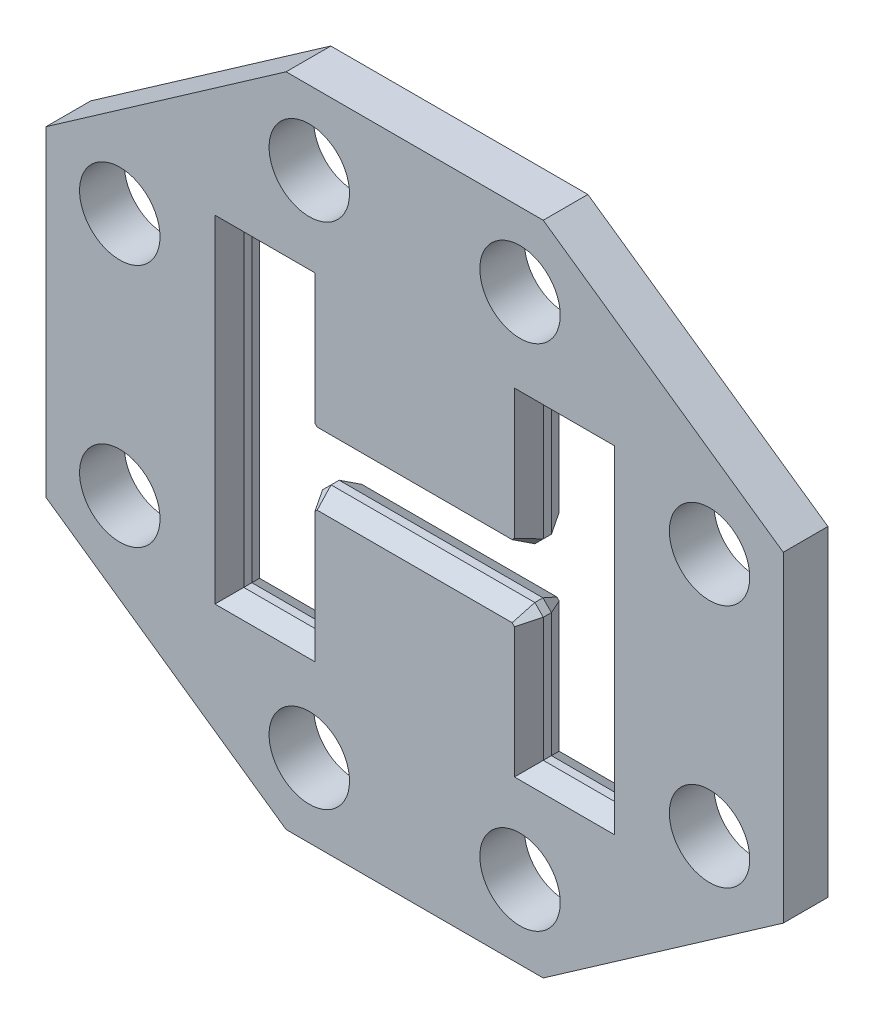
ISO-10303-21;
HEADER;
FILE_DESCRIPTION(('STEP AP214'),'2;1');
FILE_NAME('part.step','',(''),(''),'','','');
FILE_SCHEMA(('AUTOMOTIVE_DESIGN { 1 0 10303 214 1 1 1 1 }'));
ENDSEC;
DATA;
#1=APPLICATION_CONTEXT('core data for automotive mechanical design processes');
#2=APPLICATION_PROTOCOL_DEFINITION('international standard','automotive_design',2000,#1);
#3=PRODUCT_CONTEXT('',#1,'mechanical');
#4=PRODUCT('Part','Part','',(#3));
#5=PRODUCT_RELATED_PRODUCT_CATEGORY('part','',(#4));
#6=PRODUCT_DEFINITION_FORMATION('','',#4);
#7=PRODUCT_DEFINITION_CONTEXT('part definition',#1,'design');
#8=PRODUCT_DEFINITION('design','',#6,#7);
#9=PRODUCT_DEFINITION_SHAPE('','',#8);
#10=(LENGTH_UNIT() NAMED_UNIT(*) SI_UNIT(.MILLI.,.METRE.));
#11=(NAMED_UNIT(*) PLANE_ANGLE_UNIT() SI_UNIT($,.RADIAN.));
#12=(NAMED_UNIT(*) SI_UNIT($,.STERADIAN.) SOLID_ANGLE_UNIT());
#13=UNCERTAINTY_MEASURE_WITH_UNIT(LENGTH_MEASURE(1.E-05),#10,'distance_accuracy_value','');
#14=(GEOMETRIC_REPRESENTATION_CONTEXT(3) GLOBAL_UNCERTAINTY_ASSIGNED_CONTEXT((#13)) GLOBAL_UNIT_ASSIGNED_CONTEXT((#10,
#11,#12)) REPRESENTATION_CONTEXT('',''));
#15=CARTESIAN_POINT('',(0.,0.,0.));
#16=DIRECTION('',(0.,0.,1.));
#17=DIRECTION('',(1.,0.,0.));
#18=AXIS2_PLACEMENT_3D('',#15,#16,#17);
#19=CARTESIAN_POINT('',(156.845,-230.378,31.75));
#20=DIRECTION('',(1.,0.,0.));
#21=DIRECTION('',(0.,0.,-1.));
#22=AXIS2_PLACEMENT_3D('',#19,#20,#21);
#23=PLANE('',#22);
#24=DIRECTION('',(0.,0.,-1.));
#25=VECTOR('',#24,1.);
#26=CARTESIAN_POINT('',(156.845,-224.3455,31.75));
#27=LINE('',#26,#25);
#28=CARTESIAN_POINT('',(156.845,-224.3455,5.76923788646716));
#29=VERTEX_POINT('',#28);
#30=CARTESIAN_POINT('',(156.845,-224.3455,-5.76923788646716));
#31=VERTEX_POINT('',#30);
#32=EDGE_CURVE('E704',#29,#31,#27,.T.);
#33=ORIENTED_EDGE('',*,*,#32,.T.);
#34=DIRECTION('',(0.,1.,0.));
#35=VECTOR('',#34,1.);
#36=CARTESIAN_POINT('',(156.845,-230.378,-5.76923788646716));
#37=LINE('',#36,#35);
#38=CARTESIAN_POINT('',(156.845,-48.1965,-5.76923788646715));
#39=VERTEX_POINT('',#38);
#40=EDGE_CURVE('E58',#31,#39,#37,.T.);
#41=ORIENTED_EDGE('',*,*,#40,.T.);
#42=DIRECTION('',(0.,0.,-1.));
#43=VECTOR('',#42,1.);
#44=CARTESIAN_POINT('',(156.845,-48.1965,31.75));
#45=LINE('',#44,#43);
#46=CARTESIAN_POINT('',(156.845,-48.1965,5.76923788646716));
#47=VERTEX_POINT('',#46);
#48=EDGE_CURVE('E709',#47,#39,#45,.T.);
#49=ORIENTED_EDGE('',*,*,#48,.F.);
#50=DIRECTION('',(0.,-1.,0.));
#51=VECTOR('',#50,1.);
#52=CARTESIAN_POINT('',(156.845,-224.3455,5.76923788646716));
#53=LINE('',#52,#51);
#54=EDGE_CURVE('E439',#47,#29,#53,.T.);
#55=ORIENTED_EDGE('',*,*,#54,.T.);
#56=EDGE_LOOP('',(#33,#41,#49,#55));
#57=FACE_BOUND('',#56,.T.);
#58=ADVANCED_FACE('F47',(#57),#23,.T.);
#59=CARTESIAN_POINT('',(-156.845,230.378,31.75));
#60=DIRECTION('',(-1.,0.,0.));
#61=DIRECTION('',(0.,0.,1.));
#62=AXIS2_PLACEMENT_3D('',#59,#60,#61);
#63=PLANE('',#62);
#64=DIRECTION('',(0.,0.,-1.));
#65=VECTOR('',#64,1.);
#66=CARTESIAN_POINT('',(-156.845,224.3455,31.75));
#67=LINE('',#66,#65);
#68=CARTESIAN_POINT('',(-156.845,224.3455,5.76923788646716));
#69=VERTEX_POINT('',#68);
#70=CARTESIAN_POINT('',(-156.845,224.3455,-5.76923788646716));
#71=VERTEX_POINT('',#70);
#72=EDGE_CURVE('E1578',#69,#71,#67,.T.);
#73=ORIENTED_EDGE('',*,*,#72,.T.);
#74=DIRECTION('',(0.,-1.,0.));
#75=VECTOR('',#74,1.);
#76=CARTESIAN_POINT('',(-156.845,230.378,-5.76923788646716));
#77=LINE('',#76,#75);
#78=CARTESIAN_POINT('',(-156.845,48.1965,-5.76923788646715));
#79=VERTEX_POINT('',#78);
#80=EDGE_CURVE('E573',#71,#79,#77,.T.);
#81=ORIENTED_EDGE('',*,*,#80,.T.);
#82=DIRECTION('',(0.,0.,-1.));
#83=VECTOR('',#82,1.);
#84=CARTESIAN_POINT('',(-156.845,48.1965,31.75));
#85=LINE('',#84,#83);
#86=CARTESIAN_POINT('',(-156.845,48.1965,5.76923788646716));
#87=VERTEX_POINT('',#86);
#88=EDGE_CURVE('E691',#87,#79,#85,.T.);
#89=ORIENTED_EDGE('',*,*,#88,.F.);
#90=DIRECTION('',(0.,1.,0.));
#91=VECTOR('',#90,1.);
#92=CARTESIAN_POINT('',(-156.845,224.3455,5.76923788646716));
#93=LINE('',#92,#91);
#94=EDGE_CURVE('E418',#87,#69,#93,.T.);
#95=ORIENTED_EDGE('',*,*,#94,.T.);
#96=EDGE_LOOP('',(#73,#81,#89,#95));
#97=FACE_BOUND('',#96,.T.);
#98=ADVANCED_FACE('F805',(#97),#63,.T.);
#99=CARTESIAN_POINT('',(0.,0.,31.75));
#100=DIRECTION('',(0.,0.,-1.));
#101=DIRECTION('',(-1.,0.,0.));
#102=AXIS2_PLACEMENT_3D('',#99,#100,#101);
#103=PLANE('',#102);
#104=DIRECTION('',(0.,-1.,0.));
#105=VECTOR('',#104,1.);
#106=CARTESIAN_POINT('',(283.859,-224.3455,31.75));
#107=LINE('',#106,#105);
#108=CARTESIAN_POINT('',(283.859,239.3455,31.75));
#109=VERTEX_POINT('',#108);
#110=CARTESIAN_POINT('',(283.859,-239.3455,31.75));
#111=VERTEX_POINT('',#110);
#112=EDGE_CURVE('E393',#109,#111,#107,.T.);
#113=ORIENTED_EDGE('',*,*,#112,.T.);
#114=DIRECTION('',(-1.,0.,0.));
#115=VECTOR('',#114,1.);
#116=CARTESIAN_POINT('',(156.845,-239.3455,31.75));
#117=LINE('',#116,#115);
#118=CARTESIAN_POINT('',(141.845,-239.3455,31.75));
#119=VERTEX_POINT('',#118);
#120=EDGE_CURVE('E392',#111,#119,#117,.T.);
#121=ORIENTED_EDGE('',*,*,#120,.T.);
#122=DIRECTION('',(0.,1.,0.));
#123=VECTOR('',#122,1.);
#124=CARTESIAN_POINT('',(141.845,-48.1965,31.75));
#125=LINE('',#124,#123);
#126=CARTESIAN_POINT('',(141.845,-54.4097034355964,31.75));
#127=VERTEX_POINT('',#126);
#128=EDGE_CURVE('E343',#119,#127,#125,.T.);
#129=ORIENTED_EDGE('',*,*,#128,.T.);
#130=DIRECTION('',(-0.707106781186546,0.707106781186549,0.));
#131=VECTOR('',#130,1.);
#132=CARTESIAN_POINT('',(134.173398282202,-46.7381017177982,31.75));
#133=LINE('',#132,#131);
#134=CARTESIAN_POINT('',(138.566796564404,-51.1315,31.75));
#135=VERTEX_POINT('',#134);
#136=EDGE_CURVE('E355',#127,#135,#133,.T.);
#137=ORIENTED_EDGE('',*,*,#136,.T.);
#138=DIRECTION('',(-1.,0.,0.));
#139=VECTOR('',#138,1.);
#140=CARTESIAN_POINT('',(-144.78,-51.1315,31.75));
#141=LINE('',#140,#139);
#142=CARTESIAN_POINT('',(-138.566796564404,-51.1315,31.75));
#143=VERTEX_POINT('',#142);
#144=EDGE_CURVE('E354',#135,#143,#141,.T.);
#145=ORIENTED_EDGE('',*,*,#144,.T.);
#146=DIRECTION('',(-0.707106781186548,-0.707106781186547,0.));
#147=VECTOR('',#146,1.);
#148=CARTESIAN_POINT('',(-146.238398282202,-58.8031017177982,31.75));
#149=LINE('',#148,#147);
#150=CARTESIAN_POINT('',(-141.845,-54.4097034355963,31.75));
#151=VERTEX_POINT('',#150);
#152=EDGE_CURVE('E356',#143,#151,#149,.T.);
#153=ORIENTED_EDGE('',*,*,#152,.T.);
#154=DIRECTION('',(0.,-1.,0.));
#155=VECTOR('',#154,1.);
#156=CARTESIAN_POINT('',(-141.845,-224.3455,31.75));
#157=LINE('',#156,#155);
#158=CARTESIAN_POINT('',(-141.845,-239.3455,31.75));
#159=VERTEX_POINT('',#158);
#160=EDGE_CURVE('E363',#151,#159,#157,.T.);
#161=ORIENTED_EDGE('',*,*,#160,.T.);
#162=DIRECTION('',(-1.,0.,0.));
#163=VECTOR('',#162,1.);
#164=CARTESIAN_POINT('',(-268.859,-239.3455,31.75));
#165=LINE('',#164,#163);
#166=CARTESIAN_POINT('',(-283.859,-239.3455,31.75));
#167=VERTEX_POINT('',#166);
#168=EDGE_CURVE('E364',#159,#167,#165,.T.);
#169=ORIENTED_EDGE('',*,*,#168,.T.);
#170=DIRECTION('',(0.,1.,0.));
#171=VECTOR('',#170,1.);
#172=CARTESIAN_POINT('',(-283.859,224.3455,31.75));
#173=LINE('',#172,#171);
#174=CARTESIAN_POINT('',(-283.859,239.3455,31.75));
#175=VERTEX_POINT('',#174);
#176=EDGE_CURVE('E370',#167,#175,#173,.T.);
#177=ORIENTED_EDGE('',*,*,#176,.T.);
#178=DIRECTION('',(1.,0.,0.));
#179=VECTOR('',#178,1.);
#180=CARTESIAN_POINT('',(-156.845,239.3455,31.75));
#181=LINE('',#180,#179);
#182=CARTESIAN_POINT('',(-141.845,239.3455,31.75));
#183=VERTEX_POINT('',#182);
#184=EDGE_CURVE('E369',#175,#183,#181,.T.);
#185=ORIENTED_EDGE('',*,*,#184,.T.);
#186=DIRECTION('',(0.,-1.,0.));
#187=VECTOR('',#186,1.);
#188=CARTESIAN_POINT('',(-141.845,48.1965,31.75));
#189=LINE('',#188,#187);
#190=CARTESIAN_POINT('',(-141.845,54.4097034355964,31.75));
#191=VERTEX_POINT('',#190);
#192=EDGE_CURVE('E373',#183,#191,#189,.T.);
#193=ORIENTED_EDGE('',*,*,#192,.T.);
#194=DIRECTION('',(0.707106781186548,-0.707106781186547,0.));
#195=VECTOR('',#194,1.);
#196=CARTESIAN_POINT('',(-134.173398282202,46.7381017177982,31.75));
#197=LINE('',#196,#195);
#198=CARTESIAN_POINT('',(-138.566796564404,51.1315,31.75));
#199=VERTEX_POINT('',#198);
#200=EDGE_CURVE('E376',#191,#199,#197,.T.);
#201=ORIENTED_EDGE('',*,*,#200,.T.);
#202=DIRECTION('',(1.,0.,0.));
#203=VECTOR('',#202,1.);
#204=CARTESIAN_POINT('',(144.78,51.1315,31.75));
#205=LINE('',#204,#203);
#206=CARTESIAN_POINT('',(138.566796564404,51.1315,31.75));
#207=VERTEX_POINT('',#206);
#208=EDGE_CURVE('E378',#199,#207,#205,.T.);
#209=ORIENTED_EDGE('',*,*,#208,.T.);
#210=DIRECTION('',(0.707106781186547,0.707106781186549,0.));
#211=VECTOR('',#210,1.);
#212=CARTESIAN_POINT('',(146.238398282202,58.8031017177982,31.75));
#213=LINE('',#212,#211);
#214=CARTESIAN_POINT('',(141.845,54.4097034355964,31.75));
#215=VERTEX_POINT('',#214);
#216=EDGE_CURVE('E385',#207,#215,#213,.T.);
#217=ORIENTED_EDGE('',*,*,#216,.T.);
#218=DIRECTION('',(0.,1.,0.));
#219=VECTOR('',#218,1.);
#220=CARTESIAN_POINT('',(141.845,224.3455,31.75));
#221=LINE('',#220,#219);
#222=CARTESIAN_POINT('',(141.845,239.3455,31.75));
#223=VERTEX_POINT('',#222);
#224=EDGE_CURVE('E383',#215,#223,#221,.T.);
#225=ORIENTED_EDGE('',*,*,#224,.T.);
#226=DIRECTION('',(1.,0.,0.));
#227=VECTOR('',#226,1.);
#228=CARTESIAN_POINT('',(268.859,239.3455,31.75));
#229=LINE('',#228,#227);
#230=EDGE_CURVE('E390',#223,#109,#229,.T.);
#231=ORIENTED_EDGE('',*,*,#230,.T.);
#232=EDGE_LOOP('',(#113,#121,#129,#137,#145,#153,#161,#169,#177,#185,#193,#201,#209,#217,#225,#231));
#233=FACE_BOUND('',#232,.T.);
#234=CARTESIAN_POINT('',(-149.758610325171,-361.549268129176,31.75));
#235=DIRECTION('',(0.,0.,1.));
#236=DIRECTION('',(1.,0.,0.));
#237=AXIS2_PLACEMENT_3D('',#234,#235,#236);
#238=CIRCLE('',#237,57.15);
#239=CARTESIAN_POINT('',(-92.6086103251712,-361.549268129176,31.75));
#240=VERTEX_POINT('',#239);
#241=EDGE_CURVE('E1633',#240,#240,#238,.T.);
#242=ORIENTED_EDGE('',*,*,#241,.F.);
#243=EDGE_LOOP('',(#242));
#244=FACE_BOUND('',#243,.T.);
#245=CARTESIAN_POINT('',(149.758610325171,-361.549268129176,31.75));
#246=DIRECTION('',(0.,0.,1.));
#247=DIRECTION('',(1.,0.,0.));
#248=AXIS2_PLACEMENT_3D('',#245,#246,#247);
#249=CIRCLE('',#248,57.15);
#250=CARTESIAN_POINT('',(206.908610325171,-361.549268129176,31.75));
#251=VERTEX_POINT('',#250);
#252=EDGE_CURVE('E1639',#251,#251,#249,.T.);
#253=ORIENTED_EDGE('',*,*,#252,.F.);
#254=EDGE_LOOP('',(#253));
#255=FACE_BOUND('',#254,.T.);
#256=CARTESIAN_POINT('',(419.080268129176,-173.588730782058,31.75));
#257=DIRECTION('',(0.,0.,1.));
#258=DIRECTION('',(1.,0.,0.));
#259=AXIS2_PLACEMENT_3D('',#256,#257,#258);
#260=CIRCLE('',#259,57.15);
#261=CARTESIAN_POINT('',(476.230268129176,-173.588730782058,31.75));
#262=VERTEX_POINT('',#261);
#263=EDGE_CURVE('E1650',#262,#262,#260,.T.);
#264=ORIENTED_EDGE('',*,*,#263,.F.);
#265=EDGE_LOOP('',(#264));
#266=FACE_BOUND('',#265,.T.);
#267=CARTESIAN_POINT('',(419.080268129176,173.588730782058,31.75));
#268=DIRECTION('',(0.,0.,1.));
#269=DIRECTION('',(1.,0.,0.));
#270=AXIS2_PLACEMENT_3D('',#267,#268,#269);
#271=CIRCLE('',#270,57.15);
#272=CARTESIAN_POINT('',(476.230268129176,173.588730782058,31.75));
#273=VERTEX_POINT('',#272);
#274=EDGE_CURVE('E1654',#273,#273,#271,.T.);
#275=ORIENTED_EDGE('',*,*,#274,.F.);
#276=EDGE_LOOP('',(#275));
#277=FACE_BOUND('',#276,.T.);
#278=CARTESIAN_POINT('',(149.758610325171,361.549268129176,31.75));
#279=DIRECTION('',(0.,0.,1.));
#280=DIRECTION('',(1.,0.,0.));
#281=AXIS2_PLACEMENT_3D('',#278,#279,#280);
#282=CIRCLE('',#281,57.15);
#283=CARTESIAN_POINT('',(206.908610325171,361.549268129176,31.75));
#284=VERTEX_POINT('',#283);
#285=EDGE_CURVE('E1661',#284,#284,#282,.T.);
#286=ORIENTED_EDGE('',*,*,#285,.F.);
#287=EDGE_LOOP('',(#286));
#288=FACE_BOUND('',#287,.T.);
#289=CARTESIAN_POINT('',(-149.758610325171,361.549268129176,31.75));
#290=DIRECTION('',(0.,0.,1.));
#291=DIRECTION('',(1.,0.,0.));
#292=AXIS2_PLACEMENT_3D('',#289,#290,#291);
#293=CIRCLE('',#292,57.15);
#294=CARTESIAN_POINT('',(-92.6086103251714,361.549268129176,31.75));
#295=VERTEX_POINT('',#294);
#296=EDGE_CURVE('E1671',#295,#295,#293,.T.);
#297=ORIENTED_EDGE('',*,*,#296,.F.);
#298=EDGE_LOOP('',(#297));
#299=FACE_BOUND('',#298,.T.);
#300=CARTESIAN_POINT('',(-419.080268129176,173.588730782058,31.75));
#301=DIRECTION('',(0.,0.,1.));
#302=DIRECTION('',(1.,0.,0.));
#303=AXIS2_PLACEMENT_3D('',#300,#301,#302);
#304=CIRCLE('',#303,57.15);
#305=CARTESIAN_POINT('',(-361.930268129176,173.588730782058,31.75));
#306=VERTEX_POINT('',#305);
#307=EDGE_CURVE('E1629',#306,#306,#304,.T.);
#308=ORIENTED_EDGE('',*,*,#307,.F.);
#309=EDGE_LOOP('',(#308));
#310=FACE_BOUND('',#309,.T.);
#311=CARTESIAN_POINT('',(-419.080268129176,-173.588730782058,31.75));
#312=DIRECTION('',(0.,0.,1.));
#313=DIRECTION('',(1.,0.,0.));
#314=AXIS2_PLACEMENT_3D('',#311,#312,#313);
#315=CIRCLE('',#314,57.15);
#316=CARTESIAN_POINT('',(-361.930268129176,-173.588730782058,31.75));
#317=VERTEX_POINT('',#316);
#318=EDGE_CURVE('E1628',#317,#317,#315,.T.);
#319=ORIENTED_EDGE('',*,*,#318,.F.);
#320=EDGE_LOOP('',(#319));
#321=FACE_BOUND('',#320,.T.);
#322=DIRECTION('',(0.,-1.,0.));
#323=VECTOR('',#322,1.);
#324=CARTESIAN_POINT('',(-523.855268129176,-228.234235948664,31.75));
#325=LINE('',#324,#323);
#326=CARTESIAN_POINT('',(-523.855268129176,228.234235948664,31.75));
#327=VERTEX_POINT('',#326);
#328=CARTESIAN_POINT('',(-523.855268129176,-228.234235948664,31.75));
#329=VERTEX_POINT('',#328);
#330=EDGE_CURVE('E325',#327,#329,#325,.T.);
#331=ORIENTED_EDGE('',*,*,#330,.T.);
#332=DIRECTION('',(0.820038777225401,-0.572307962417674,0.));
#333=VECTOR('',#332,1.);
#334=CARTESIAN_POINT('',(-182.70492307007,-466.324268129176,31.75));
#335=LINE('',#334,#333);
#336=CARTESIAN_POINT('',(-182.70492307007,-466.324268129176,31.75));
#337=VERTEX_POINT('',#336);
#338=EDGE_CURVE('E311',#329,#337,#335,.T.);
#339=ORIENTED_EDGE('',*,*,#338,.T.);
#340=DIRECTION('',(1.,0.,0.));
#341=VECTOR('',#340,1.);
#342=CARTESIAN_POINT('',(182.70492307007,-466.324268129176,31.75));
#343=LINE('',#342,#341);
#344=CARTESIAN_POINT('',(182.70492307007,-466.324268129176,31.75));
#345=VERTEX_POINT('',#344);
#346=EDGE_CURVE('E321',#337,#345,#343,.T.);
#347=ORIENTED_EDGE('',*,*,#346,.T.);
#348=DIRECTION('',(0.820038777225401,0.572307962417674,0.));
#349=VECTOR('',#348,1.);
#350=CARTESIAN_POINT('',(523.855268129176,-228.234235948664,31.75));
#351=LINE('',#350,#349);
#352=CARTESIAN_POINT('',(523.855268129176,-228.234235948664,31.75));
#353=VERTEX_POINT('',#352);
#354=EDGE_CURVE('E715',#345,#353,#351,.T.);
#355=ORIENTED_EDGE('',*,*,#354,.T.);
#356=DIRECTION('',(0.,1.,0.));
#357=VECTOR('',#356,1.);
#358=CARTESIAN_POINT('',(523.855268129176,228.234235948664,31.75));
#359=LINE('',#358,#357);
#360=CARTESIAN_POINT('',(523.855268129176,228.234235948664,31.75));
#361=VERTEX_POINT('',#360);
#362=EDGE_CURVE('E718',#353,#361,#359,.T.);
#363=ORIENTED_EDGE('',*,*,#362,.T.);
#364=DIRECTION('',(-0.820038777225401,0.572307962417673,0.));
#365=VECTOR('',#364,1.);
#366=CARTESIAN_POINT('',(182.70492307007,466.324268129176,31.75));
#367=LINE('',#366,#365);
#368=CARTESIAN_POINT('',(182.70492307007,466.324268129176,31.75));
#369=VERTEX_POINT('',#368);
#370=EDGE_CURVE('E717',#361,#369,#367,.T.);
#371=ORIENTED_EDGE('',*,*,#370,.T.);
#372=DIRECTION('',(-1.,0.,0.));
#373=VECTOR('',#372,1.);
#374=CARTESIAN_POINT('',(-182.704923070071,466.324268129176,31.75));
#375=LINE('',#374,#373);
#376=CARTESIAN_POINT('',(-182.704923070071,466.324268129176,31.75));
#377=VERTEX_POINT('',#376);
#378=EDGE_CURVE('E725',#369,#377,#375,.T.);
#379=ORIENTED_EDGE('',*,*,#378,.T.);
#380=DIRECTION('',(-0.8200387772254,-0.572307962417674,0.));
#381=VECTOR('',#380,1.);
#382=CARTESIAN_POINT('',(-523.855268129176,228.234235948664,31.75));
#383=LINE('',#382,#381);
#384=EDGE_CURVE('E326',#377,#327,#383,.T.);
#385=ORIENTED_EDGE('',*,*,#384,.T.);
#386=EDGE_LOOP('',(#331,#339,#347,#355,#363,#371,#379,#385));
#387=FACE_BOUND('',#386,.T.);
#388=ADVANCED_FACE('F328',(#233,#244,#255,#266,#277,#288,#299,#310,#321,#387),#103,.F.);
#389=CARTESIAN_POINT('',(0.,0.,-31.75));
#390=DIRECTION('',(0.,0.,-1.));
#391=DIRECTION('',(-1.,0.,0.));
#392=AXIS2_PLACEMENT_3D('',#389,#390,#391);
#393=PLANE('',#392);
#394=DIRECTION('',(0.707106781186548,0.707106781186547,0.));
#395=VECTOR('',#394,1.);
#396=CARTESIAN_POINT('',(-43.7176482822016,43.7176482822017,-31.75));
#397=LINE('',#396,#395);
#398=CARTESIAN_POINT('',(-141.845,-54.4097034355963,-31.75));
#399=VERTEX_POINT('',#398);
#400=CARTESIAN_POINT('',(-138.566796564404,-51.1315,-31.75));
#401=VERTEX_POINT('',#400);
#402=EDGE_CURVE('E546',#399,#401,#397,.T.);
#403=ORIENTED_EDGE('',*,*,#402,.T.);
#404=DIRECTION('',(1.,0.,0.));
#405=VECTOR('',#404,1.);
#406=CARTESIAN_POINT('',(0.,-51.1315,-31.75));
#407=LINE('',#406,#405);
#408=CARTESIAN_POINT('',(138.566796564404,-51.1315,-31.75));
#409=VERTEX_POINT('',#408);
#410=EDGE_CURVE('E553',#401,#409,#407,.T.);
#411=ORIENTED_EDGE('',*,*,#410,.T.);
#412=DIRECTION('',(0.707106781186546,-0.707106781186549,0.));
#413=VECTOR('',#412,1.);
#414=CARTESIAN_POINT('',(43.717648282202,43.7176482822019,-31.75));
#415=LINE('',#414,#413);
#416=CARTESIAN_POINT('',(141.845,-54.4097034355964,-31.75));
#417=VERTEX_POINT('',#416);
#418=EDGE_CURVE('E442',#409,#417,#415,.T.);
#419=ORIENTED_EDGE('',*,*,#418,.T.);
#420=DIRECTION('',(0.,-1.,0.));
#421=VECTOR('',#420,1.);
#422=CARTESIAN_POINT('',(141.845,0.,-31.75));
#423=LINE('',#422,#421);
#424=CARTESIAN_POINT('',(141.845,-239.3455,-31.75));
#425=VERTEX_POINT('',#424);
#426=EDGE_CURVE('E508',#417,#425,#423,.T.);
#427=ORIENTED_EDGE('',*,*,#426,.T.);
#428=DIRECTION('',(1.,0.,0.));
#429=VECTOR('',#428,1.);
#430=CARTESIAN_POINT('',(0.,-239.3455,-31.75));
#431=LINE('',#430,#429);
#432=CARTESIAN_POINT('',(283.859,-239.3455,-31.75));
#433=VERTEX_POINT('',#432);
#434=EDGE_CURVE('E515',#425,#433,#431,.T.);
#435=ORIENTED_EDGE('',*,*,#434,.T.);
#436=DIRECTION('',(0.,1.,0.));
#437=VECTOR('',#436,1.);
#438=CARTESIAN_POINT('',(283.859,0.,-31.75));
#439=LINE('',#438,#437);
#440=CARTESIAN_POINT('',(283.859,239.3455,-31.75));
#441=VERTEX_POINT('',#440);
#442=EDGE_CURVE('E513',#433,#441,#439,.T.);
#443=ORIENTED_EDGE('',*,*,#442,.T.);
#444=DIRECTION('',(-1.,0.,0.));
#445=VECTOR('',#444,1.);
#446=CARTESIAN_POINT('',(0.,239.3455,-31.75));
#447=LINE('',#446,#445);
#448=CARTESIAN_POINT('',(141.845,239.3455,-31.75));
#449=VERTEX_POINT('',#448);
#450=EDGE_CURVE('E520',#441,#449,#447,.T.);
#451=ORIENTED_EDGE('',*,*,#450,.T.);
#452=DIRECTION('',(0.,-1.,0.));
#453=VECTOR('',#452,1.);
#454=CARTESIAN_POINT('',(141.845,0.,-31.75));
#455=LINE('',#454,#453);
#456=CARTESIAN_POINT('',(141.845,54.4097034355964,-31.75));
#457=VERTEX_POINT('',#456);
#458=EDGE_CURVE('E523',#449,#457,#455,.T.);
#459=ORIENTED_EDGE('',*,*,#458,.T.);
#460=DIRECTION('',(-0.707106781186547,-0.707106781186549,0.));
#461=VECTOR('',#460,1.);
#462=CARTESIAN_POINT('',(43.717648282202,-43.7176482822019,-31.75));
#463=LINE('',#462,#461);
#464=CARTESIAN_POINT('',(138.566796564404,51.1315000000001,-31.75));
#465=VERTEX_POINT('',#464);
#466=EDGE_CURVE('E522',#457,#465,#463,.T.);
#467=ORIENTED_EDGE('',*,*,#466,.T.);
#468=DIRECTION('',(-1.,0.,0.));
#469=VECTOR('',#468,1.);
#470=CARTESIAN_POINT('',(0.,51.1315000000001,-31.75));
#471=LINE('',#470,#469);
#472=CARTESIAN_POINT('',(-138.566796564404,51.1315000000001,-31.75));
#473=VERTEX_POINT('',#472);
#474=EDGE_CURVE('E530',#465,#473,#471,.T.);
#475=ORIENTED_EDGE('',*,*,#474,.T.);
#476=DIRECTION('',(-0.707106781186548,0.707106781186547,0.));
#477=VECTOR('',#476,1.);
#478=CARTESIAN_POINT('',(-43.7176482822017,-43.7176482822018,-31.75));
#479=LINE('',#478,#477);
#480=CARTESIAN_POINT('',(-141.845,54.4097034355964,-31.75));
#481=VERTEX_POINT('',#480);
#482=EDGE_CURVE('E529',#473,#481,#479,.T.);
#483=ORIENTED_EDGE('',*,*,#482,.T.);
#484=DIRECTION('',(0.,1.,0.));
#485=VECTOR('',#484,1.);
#486=CARTESIAN_POINT('',(-141.845,0.,-31.75));
#487=LINE('',#486,#485);
#488=CARTESIAN_POINT('',(-141.845,239.3455,-31.75));
#489=VERTEX_POINT('',#488);
#490=EDGE_CURVE('E531',#481,#489,#487,.T.);
#491=ORIENTED_EDGE('',*,*,#490,.T.);
#492=DIRECTION('',(-1.,0.,0.));
#493=VECTOR('',#492,1.);
#494=CARTESIAN_POINT('',(0.,239.3455,-31.75));
#495=LINE('',#494,#493);
#496=CARTESIAN_POINT('',(-283.859,239.3455,-31.75));
#497=VERTEX_POINT('',#496);
#498=EDGE_CURVE('E539',#489,#497,#495,.T.);
#499=ORIENTED_EDGE('',*,*,#498,.T.);
#500=DIRECTION('',(0.,-1.,0.));
#501=VECTOR('',#500,1.);
#502=CARTESIAN_POINT('',(-283.859,0.,-31.75));
#503=LINE('',#502,#501);
#504=CARTESIAN_POINT('',(-283.859,-239.3455,-31.75));
#505=VERTEX_POINT('',#504);
#506=EDGE_CURVE('E538',#497,#505,#503,.T.);
#507=ORIENTED_EDGE('',*,*,#506,.T.);
#508=DIRECTION('',(1.,0.,0.));
#509=VECTOR('',#508,1.);
#510=CARTESIAN_POINT('',(0.,-239.3455,-31.75));
#511=LINE('',#510,#509);
#512=CARTESIAN_POINT('',(-141.845,-239.3455,-31.75));
#513=VERTEX_POINT('',#512);
#514=EDGE_CURVE('E545',#505,#513,#511,.T.);
#515=ORIENTED_EDGE('',*,*,#514,.T.);
#516=DIRECTION('',(0.,1.,0.));
#517=VECTOR('',#516,1.);
#518=CARTESIAN_POINT('',(-141.845,0.,-31.75));
#519=LINE('',#518,#517);
#520=EDGE_CURVE('E544',#513,#399,#519,.T.);
#521=ORIENTED_EDGE('',*,*,#520,.T.);
#522=EDGE_LOOP('',(#403,#411,#419,#427,#435,#443,#451,#459,#467,#475,#483,#491,#499,#507,#515,#521));
#523=FACE_BOUND('',#522,.T.);
#524=CARTESIAN_POINT('',(-149.758610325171,-361.549268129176,-31.75));
#525=DIRECTION('',(0.,0.,1.));
#526=DIRECTION('',(1.,0.,0.));
#527=AXIS2_PLACEMENT_3D('',#524,#525,#526);
#528=CIRCLE('',#527,57.15);
#529=CARTESIAN_POINT('',(-92.6086103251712,-361.549268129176,-31.75));
#530=VERTEX_POINT('',#529);
#531=EDGE_CURVE('E506',#530,#530,#528,.T.);
#532=ORIENTED_EDGE('',*,*,#531,.T.);
#533=EDGE_LOOP('',(#532));
#534=FACE_BOUND('',#533,.T.);
#535=CARTESIAN_POINT('',(149.758610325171,-361.549268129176,-31.75));
#536=DIRECTION('',(0.,0.,1.));
#537=DIRECTION('',(1.,0.,0.));
#538=AXIS2_PLACEMENT_3D('',#535,#536,#537);
#539=CIRCLE('',#538,57.15);
#540=CARTESIAN_POINT('',(206.908610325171,-361.549268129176,-31.75));
#541=VERTEX_POINT('',#540);
#542=EDGE_CURVE('E1634',#541,#541,#539,.T.);
#543=ORIENTED_EDGE('',*,*,#542,.T.);
#544=EDGE_LOOP('',(#543));
#545=FACE_BOUND('',#544,.T.);
#546=CARTESIAN_POINT('',(419.080268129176,-173.588730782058,-31.75));
#547=DIRECTION('',(0.,0.,1.));
#548=DIRECTION('',(1.,0.,0.));
#549=AXIS2_PLACEMENT_3D('',#546,#547,#548);
#550=CIRCLE('',#549,57.15);
#551=CARTESIAN_POINT('',(476.230268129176,-173.588730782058,-31.75));
#552=VERTEX_POINT('',#551);
#553=EDGE_CURVE('E1645',#552,#552,#550,.T.);
#554=ORIENTED_EDGE('',*,*,#553,.T.);
#555=EDGE_LOOP('',(#554));
#556=FACE_BOUND('',#555,.T.);
#557=CARTESIAN_POINT('',(419.080268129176,173.588730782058,-31.75));
#558=DIRECTION('',(0.,0.,1.));
#559=DIRECTION('',(1.,0.,0.));
#560=AXIS2_PLACEMENT_3D('',#557,#558,#559);
#561=CIRCLE('',#560,57.15);
#562=CARTESIAN_POINT('',(476.230268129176,173.588730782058,-31.75));
#563=VERTEX_POINT('',#562);
#564=EDGE_CURVE('E1653',#563,#563,#561,.T.);
#565=ORIENTED_EDGE('',*,*,#564,.T.);
#566=EDGE_LOOP('',(#565));
#567=FACE_BOUND('',#566,.T.);
#568=CARTESIAN_POINT('',(149.758610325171,361.549268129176,-31.75));
#569=DIRECTION('',(0.,0.,1.));
#570=DIRECTION('',(1.,0.,0.));
#571=AXIS2_PLACEMENT_3D('',#568,#569,#570);
#572=CIRCLE('',#571,57.15);
#573=CARTESIAN_POINT('',(206.908610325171,361.549268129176,-31.75));
#574=VERTEX_POINT('',#573);
#575=EDGE_CURVE('E1660',#574,#574,#572,.T.);
#576=ORIENTED_EDGE('',*,*,#575,.T.);
#577=EDGE_LOOP('',(#576));
#578=FACE_BOUND('',#577,.T.);
#579=CARTESIAN_POINT('',(-149.758610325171,361.549268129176,-31.75));
#580=DIRECTION('',(0.,0.,1.));
#581=DIRECTION('',(1.,0.,0.));
#582=AXIS2_PLACEMENT_3D('',#579,#580,#581);
#583=CIRCLE('',#582,57.15);
#584=CARTESIAN_POINT('',(-92.6086103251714,361.549268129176,-31.75));
#585=VERTEX_POINT('',#584);
#586=EDGE_CURVE('E1670',#585,#585,#583,.T.);
#587=ORIENTED_EDGE('',*,*,#586,.T.);
#588=EDGE_LOOP('',(#587));
#589=FACE_BOUND('',#588,.T.);
#590=CARTESIAN_POINT('',(-419.080268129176,173.588730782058,-31.75));
#591=DIRECTION('',(0.,0.,1.));
#592=DIRECTION('',(1.,0.,0.));
#593=AXIS2_PLACEMENT_3D('',#590,#591,#592);
#594=CIRCLE('',#593,57.15);
#595=CARTESIAN_POINT('',(-361.930268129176,173.588730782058,-31.75));
#596=VERTEX_POINT('',#595);
#597=EDGE_CURVE('E1674',#596,#596,#594,.T.);
#598=ORIENTED_EDGE('',*,*,#597,.T.);
#599=EDGE_LOOP('',(#598));
#600=FACE_BOUND('',#599,.T.);
#601=CARTESIAN_POINT('',(-419.080268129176,-173.588730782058,-31.75));
#602=DIRECTION('',(0.,0.,1.));
#603=DIRECTION('',(1.,0.,0.));
#604=AXIS2_PLACEMENT_3D('',#601,#602,#603);
#605=CIRCLE('',#604,57.15);
#606=CARTESIAN_POINT('',(-361.930268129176,-173.588730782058,-31.75));
#607=VERTEX_POINT('',#606);
#608=EDGE_CURVE('E1621',#607,#607,#605,.T.);
#609=ORIENTED_EDGE('',*,*,#608,.T.);
#610=EDGE_LOOP('',(#609));
#611=FACE_BOUND('',#610,.T.);
#612=DIRECTION('',(0.,-1.,0.));
#613=VECTOR('',#612,1.);
#614=CARTESIAN_POINT('',(-523.855268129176,-228.234235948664,-31.75));
#615=LINE('',#614,#613);
#616=CARTESIAN_POINT('',(-523.855268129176,228.234235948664,-31.75));
#617=VERTEX_POINT('',#616);
#618=CARTESIAN_POINT('',(-523.855268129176,-228.234235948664,-31.75));
#619=VERTEX_POINT('',#618);
#620=EDGE_CURVE('E340',#617,#619,#615,.T.);
#621=ORIENTED_EDGE('',*,*,#620,.F.);
#622=DIRECTION('',(-0.8200387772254,-0.572307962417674,0.));
#623=VECTOR('',#622,1.);
#624=CARTESIAN_POINT('',(-523.855268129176,228.234235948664,-31.75));
#625=LINE('',#624,#623);
#626=CARTESIAN_POINT('',(-182.704923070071,466.324268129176,-31.75));
#627=VERTEX_POINT('',#626);
#628=EDGE_CURVE('E331',#627,#617,#625,.T.);
#629=ORIENTED_EDGE('',*,*,#628,.F.);
#630=DIRECTION('',(-1.,0.,0.));
#631=VECTOR('',#630,1.);
#632=CARTESIAN_POINT('',(-182.704923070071,466.324268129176,-31.75));
#633=LINE('',#632,#631);
#634=CARTESIAN_POINT('',(182.70492307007,466.324268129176,-31.75));
#635=VERTEX_POINT('',#634);
#636=EDGE_CURVE('E744',#635,#627,#633,.T.);
#637=ORIENTED_EDGE('',*,*,#636,.F.);
#638=DIRECTION('',(-0.820038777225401,0.572307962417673,0.));
#639=VECTOR('',#638,1.);
#640=CARTESIAN_POINT('',(182.70492307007,466.324268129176,-31.75));
#641=LINE('',#640,#639);
#642=CARTESIAN_POINT('',(523.855268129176,228.234235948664,-31.75));
#643=VERTEX_POINT('',#642);
#644=EDGE_CURVE('E745',#643,#635,#641,.T.);
#645=ORIENTED_EDGE('',*,*,#644,.F.);
#646=DIRECTION('',(0.,1.,0.));
#647=VECTOR('',#646,1.);
#648=CARTESIAN_POINT('',(523.855268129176,228.234235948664,-31.75));
#649=LINE('',#648,#647);
#650=CARTESIAN_POINT('',(523.855268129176,-228.234235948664,-31.75));
#651=VERTEX_POINT('',#650);
#652=EDGE_CURVE('E737',#651,#643,#649,.T.);
#653=ORIENTED_EDGE('',*,*,#652,.F.);
#654=DIRECTION('',(0.820038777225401,0.572307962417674,0.));
#655=VECTOR('',#654,1.);
#656=CARTESIAN_POINT('',(523.855268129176,-228.234235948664,-31.75));
#657=LINE('',#656,#655);
#658=CARTESIAN_POINT('',(182.70492307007,-466.324268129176,-31.75));
#659=VERTEX_POINT('',#658);
#660=EDGE_CURVE('E738',#659,#651,#657,.T.);
#661=ORIENTED_EDGE('',*,*,#660,.F.);
#662=DIRECTION('',(1.,0.,0.));
#663=VECTOR('',#662,1.);
#664=CARTESIAN_POINT('',(182.70492307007,-466.324268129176,-31.75));
#665=LINE('',#664,#663);
#666=CARTESIAN_POINT('',(-182.70492307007,-466.324268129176,-31.75));
#667=VERTEX_POINT('',#666);
#668=EDGE_CURVE('E735',#667,#659,#665,.T.);
#669=ORIENTED_EDGE('',*,*,#668,.F.);
#670=DIRECTION('',(0.820038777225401,-0.572307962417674,0.));
#671=VECTOR('',#670,1.);
#672=CARTESIAN_POINT('',(-182.70492307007,-466.324268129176,-31.75));
#673=LINE('',#672,#671);
#674=EDGE_CURVE('E728',#619,#667,#673,.T.);
#675=ORIENTED_EDGE('',*,*,#674,.F.);
#676=EDGE_LOOP('',(#621,#629,#637,#645,#653,#661,#669,#675));
#677=FACE_BOUND('',#676,.T.);
#678=ADVANCED_FACE('F778',(#523,#534,#545,#556,#567,#578,#589,#600,#611,#677),#393,.T.);
#679=CARTESIAN_POINT('',(-523.855268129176,-228.234235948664,31.75));
#680=DIRECTION('',(1.,0.,0.));
#681=DIRECTION('',(0.,0.,-1.));
#682=AXIS2_PLACEMENT_3D('',#679,#680,#681);
#683=PLANE('',#682);
#684=ORIENTED_EDGE('',*,*,#620,.T.);
#685=DIRECTION('',(0.,0.,-1.));
#686=VECTOR('',#685,1.);
#687=CARTESIAN_POINT('',(-523.855268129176,-228.234235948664,31.75));
#688=LINE('',#687,#686);
#689=EDGE_CURVE('E314',#329,#619,#688,.T.);
#690=ORIENTED_EDGE('',*,*,#689,.F.);
#691=ORIENTED_EDGE('',*,*,#330,.F.);
#692=DIRECTION('',(0.,0.,-1.));
#693=VECTOR('',#692,1.);
#694=CARTESIAN_POINT('',(-523.855268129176,228.234235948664,31.75));
#695=LINE('',#694,#693);
#696=EDGE_CURVE('E730',#327,#617,#695,.T.);
#697=ORIENTED_EDGE('',*,*,#696,.T.);
#698=EDGE_LOOP('',(#684,#690,#691,#697));
#699=FACE_BOUND('',#698,.T.);
#700=ADVANCED_FACE('F334',(#699),#683,.F.);
#701=CARTESIAN_POINT('',(-182.70492307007,-466.324268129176,31.75));
#702=DIRECTION('',(0.572307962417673,0.820038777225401,0.));
#703=DIRECTION('',(-0.820038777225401,0.572307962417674,0.));
#704=AXIS2_PLACEMENT_3D('',#701,#702,#703);
#705=PLANE('',#704);
#706=ORIENTED_EDGE('',*,*,#674,.T.);
#707=DIRECTION('',(0.,0.,-1.));
#708=VECTOR('',#707,1.);
#709=CARTESIAN_POINT('',(-182.70492307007,-466.324268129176,31.75));
#710=LINE('',#709,#708);
#711=EDGE_CURVE('E319',#337,#667,#710,.T.);
#712=ORIENTED_EDGE('',*,*,#711,.F.);
#713=ORIENTED_EDGE('',*,*,#338,.F.);
#714=ORIENTED_EDGE('',*,*,#689,.T.);
#715=EDGE_LOOP('',(#706,#712,#713,#714));
#716=FACE_BOUND('',#715,.T.);
#717=ADVANCED_FACE('F312',(#716),#705,.F.);
#718=CARTESIAN_POINT('',(182.70492307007,-466.324268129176,31.75));
#719=DIRECTION('',(0.,1.,0.));
#720=DIRECTION('',(0.,0.,1.));
#721=AXIS2_PLACEMENT_3D('',#718,#719,#720);
#722=PLANE('',#721);
#723=ORIENTED_EDGE('',*,*,#668,.T.);
#724=DIRECTION('',(0.,0.,-1.));
#725=VECTOR('',#724,1.);
#726=CARTESIAN_POINT('',(182.70492307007,-466.324268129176,31.75));
#727=LINE('',#726,#725);
#728=EDGE_CURVE('E348',#345,#659,#727,.T.);
#729=ORIENTED_EDGE('',*,*,#728,.F.);
#730=ORIENTED_EDGE('',*,*,#346,.F.);
#731=ORIENTED_EDGE('',*,*,#711,.T.);
#732=EDGE_LOOP('',(#723,#729,#730,#731));
#733=FACE_BOUND('',#732,.T.);
#734=ADVANCED_FACE('F795',(#733),#722,.F.);
#735=CARTESIAN_POINT('',(523.855268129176,-228.234235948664,31.75));
#736=DIRECTION('',(-0.572307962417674,0.820038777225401,0.));
#737=DIRECTION('',(-0.820038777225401,-0.572307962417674,0.));
#738=AXIS2_PLACEMENT_3D('',#735,#736,#737);
#739=PLANE('',#738);
#740=ORIENTED_EDGE('',*,*,#660,.T.);
#741=DIRECTION('',(0.,0.,-1.));
#742=VECTOR('',#741,1.);
#743=CARTESIAN_POINT('',(523.855268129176,-228.234235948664,31.75));
#744=LINE('',#743,#742);
#745=EDGE_CURVE('E762',#353,#651,#744,.T.);
#746=ORIENTED_EDGE('',*,*,#745,.F.);
#747=ORIENTED_EDGE('',*,*,#354,.F.);
#748=ORIENTED_EDGE('',*,*,#728,.T.);
#749=EDGE_LOOP('',(#740,#746,#747,#748));
#750=FACE_BOUND('',#749,.T.);
#751=ADVANCED_FACE('F774',(#750),#739,.F.);
#752=CARTESIAN_POINT('',(523.855268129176,228.234235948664,31.75));
#753=DIRECTION('',(-1.,0.,0.));
#754=DIRECTION('',(0.,-1.,0.));
#755=AXIS2_PLACEMENT_3D('',#752,#753,#754);
#756=PLANE('',#755);
#757=ORIENTED_EDGE('',*,*,#652,.T.);
#758=DIRECTION('',(0.,0.,-1.));
#759=VECTOR('',#758,1.);
#760=CARTESIAN_POINT('',(523.855268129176,228.234235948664,31.75));
#761=LINE('',#760,#759);
#762=EDGE_CURVE('E759',#361,#643,#761,.T.);
#763=ORIENTED_EDGE('',*,*,#762,.F.);
#764=ORIENTED_EDGE('',*,*,#362,.F.);
#765=ORIENTED_EDGE('',*,*,#745,.T.);
#766=EDGE_LOOP('',(#757,#763,#764,#765));
#767=FACE_BOUND('',#766,.T.);
#768=ADVANCED_FACE('F782',(#767),#756,.F.);
#769=CARTESIAN_POINT('',(182.70492307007,466.324268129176,31.75));
#770=DIRECTION('',(-0.572307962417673,-0.820038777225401,0.));
#771=DIRECTION('',(0.820038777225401,-0.572307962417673,0.));
#772=AXIS2_PLACEMENT_3D('',#769,#770,#771);
#773=PLANE('',#772);
#774=ORIENTED_EDGE('',*,*,#644,.T.);
#775=DIRECTION('',(0.,0.,-1.));
#776=VECTOR('',#775,1.);
#777=CARTESIAN_POINT('',(182.70492307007,466.324268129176,31.75));
#778=LINE('',#777,#776);
#779=EDGE_CURVE('E756',#369,#635,#778,.T.);
#780=ORIENTED_EDGE('',*,*,#779,.F.);
#781=ORIENTED_EDGE('',*,*,#370,.F.);
#782=ORIENTED_EDGE('',*,*,#762,.T.);
#783=EDGE_LOOP('',(#774,#780,#781,#782));
#784=FACE_BOUND('',#783,.T.);
#785=ADVANCED_FACE('F786',(#784),#773,.F.);
#786=CARTESIAN_POINT('',(-182.704923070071,466.324268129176,31.75));
#787=DIRECTION('',(0.,-1.,0.));
#788=DIRECTION('',(1.,0.,0.));
#789=AXIS2_PLACEMENT_3D('',#786,#787,#788);
#790=PLANE('',#789);
#791=ORIENTED_EDGE('',*,*,#636,.T.);
#792=DIRECTION('',(0.,0.,-1.));
#793=VECTOR('',#792,1.);
#794=CARTESIAN_POINT('',(-182.704923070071,466.324268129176,31.75));
#795=LINE('',#794,#793);
#796=EDGE_CURVE('E755',#377,#627,#795,.T.);
#797=ORIENTED_EDGE('',*,*,#796,.F.);
#798=ORIENTED_EDGE('',*,*,#378,.F.);
#799=ORIENTED_EDGE('',*,*,#779,.T.);
#800=EDGE_LOOP('',(#791,#797,#798,#799));
#801=FACE_BOUND('',#800,.T.);
#802=ADVANCED_FACE('F825',(#801),#790,.F.);
#803=CARTESIAN_POINT('',(-523.855268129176,228.234235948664,31.75));
#804=DIRECTION('',(0.572307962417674,-0.820038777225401,0.));
#805=DIRECTION('',(0.820038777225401,0.572307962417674,0.));
#806=AXIS2_PLACEMENT_3D('',#803,#804,#805);
#807=PLANE('',#806);
#808=ORIENTED_EDGE('',*,*,#628,.T.);
#809=ORIENTED_EDGE('',*,*,#696,.F.);
#810=ORIENTED_EDGE('',*,*,#384,.F.);
#811=ORIENTED_EDGE('',*,*,#796,.T.);
#812=EDGE_LOOP('',(#808,#809,#810,#811));
#813=FACE_BOUND('',#812,.T.);
#814=ADVANCED_FACE('F819',(#813),#807,.F.);
#815=CARTESIAN_POINT('',(156.845,54.2290000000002,31.75));
#816=DIRECTION('',(1.,0.,0.));
#817=DIRECTION('',(0.,0.,-1.));
#818=AXIS2_PLACEMENT_3D('',#815,#816,#817);
#819=PLANE('',#818);
#820=DIRECTION('',(0.,0.,-1.));
#821=VECTOR('',#820,1.);
#822=CARTESIAN_POINT('',(156.845,48.1965,31.75));
#823=LINE('',#822,#821);
#824=CARTESIAN_POINT('',(156.845,48.1965,5.76923788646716));
#825=VERTEX_POINT('',#824);
#826=CARTESIAN_POINT('',(156.845,48.1965,-5.76923788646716));
#827=VERTEX_POINT('',#826);
#828=EDGE_CURVE('E684',#825,#827,#823,.T.);
#829=ORIENTED_EDGE('',*,*,#828,.T.);
#830=DIRECTION('',(0.,1.,0.));
#831=VECTOR('',#830,1.);
#832=CARTESIAN_POINT('',(156.845,54.2290000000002,-5.76923788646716));
#833=LINE('',#832,#831);
#834=CARTESIAN_POINT('',(156.845,224.3455,-5.76923788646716));
#835=VERTEX_POINT('',#834);
#836=EDGE_CURVE('E588',#827,#835,#833,.T.);
#837=ORIENTED_EDGE('',*,*,#836,.T.);
#838=DIRECTION('',(0.,0.,-1.));
#839=VECTOR('',#838,1.);
#840=CARTESIAN_POINT('',(156.845,224.3455,31.75));
#841=LINE('',#840,#839);
#842=CARTESIAN_POINT('',(156.845,224.3455,5.76923788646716));
#843=VERTEX_POINT('',#842);
#844=EDGE_CURVE('E689',#843,#835,#841,.T.);
#845=ORIENTED_EDGE('',*,*,#844,.F.);
#846=DIRECTION('',(0.,-1.,0.));
#847=VECTOR('',#846,1.);
#848=CARTESIAN_POINT('',(156.845,48.1965,5.76923788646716));
#849=LINE('',#848,#847);
#850=EDGE_CURVE('E404',#843,#825,#849,.T.);
#851=ORIENTED_EDGE('',*,*,#850,.T.);
#852=EDGE_LOOP('',(#829,#837,#845,#851));
#853=FACE_BOUND('',#852,.T.);
#854=ADVANCED_FACE('F812',(#853),#819,.T.);
#855=CARTESIAN_POINT('',(-156.845,-54.2289999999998,31.75));
#856=DIRECTION('',(-1.,0.,0.));
#857=DIRECTION('',(0.,0.,1.));
#858=AXIS2_PLACEMENT_3D('',#855,#856,#857);
#859=PLANE('',#858);
#860=DIRECTION('',(0.,0.,-1.));
#861=VECTOR('',#860,1.);
#862=CARTESIAN_POINT('',(-156.845,-48.1965,31.75));
#863=LINE('',#862,#861);
#864=CARTESIAN_POINT('',(-156.845,-48.1965,5.76923788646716));
#865=VERTEX_POINT('',#864);
#866=CARTESIAN_POINT('',(-156.845,-48.1965,-5.76923788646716));
#867=VERTEX_POINT('',#866);
#868=EDGE_CURVE('E1610',#865,#867,#863,.T.);
#869=ORIENTED_EDGE('',*,*,#868,.T.);
#870=DIRECTION('',(0.,-1.,0.));
#871=VECTOR('',#870,1.);
#872=CARTESIAN_POINT('',(-156.845,-54.2289999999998,-5.76923788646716));
#873=LINE('',#872,#871);
#874=CARTESIAN_POINT('',(-156.845,-224.3455,-5.76923788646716));
#875=VERTEX_POINT('',#874);
#876=EDGE_CURVE('E565',#867,#875,#873,.T.);
#877=ORIENTED_EDGE('',*,*,#876,.T.);
#878=DIRECTION('',(0.,0.,-1.));
#879=VECTOR('',#878,1.);
#880=CARTESIAN_POINT('',(-156.845,-224.3455,31.75));
#881=LINE('',#880,#879);
#882=CARTESIAN_POINT('',(-156.845,-224.3455,5.76923788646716));
#883=VERTEX_POINT('',#882);
#884=EDGE_CURVE('E1605',#883,#875,#881,.T.);
#885=ORIENTED_EDGE('',*,*,#884,.F.);
#886=DIRECTION('',(0.,1.,0.));
#887=VECTOR('',#886,1.);
#888=CARTESIAN_POINT('',(-156.845,-48.1965,5.76923788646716));
#889=LINE('',#888,#887);
#890=EDGE_CURVE('E426',#883,#865,#889,.T.);
#891=ORIENTED_EDGE('',*,*,#890,.T.);
#892=EDGE_LOOP('',(#869,#877,#885,#891));
#893=FACE_BOUND('',#892,.T.);
#894=ADVANCED_FACE('F1360',(#893),#859,.T.);
#895=CARTESIAN_POINT('',(156.845,-48.1965,31.75));
#896=DIRECTION('',(0.707106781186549,0.707106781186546,0.));
#897=DIRECTION('',(-0.707106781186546,0.707106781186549,0.));
#898=AXIS2_PLACEMENT_3D('',#895,#896,#897);
#899=PLANE('',#898);
#900=ORIENTED_EDGE('',*,*,#48,.T.);
#901=DIRECTION('',(-0.707106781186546,0.707106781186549,0.));
#902=VECTOR('',#901,1.);
#903=CARTESIAN_POINT('',(156.845,-48.1965,-5.76923788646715));
#904=LINE('',#903,#902);
#905=CARTESIAN_POINT('',(144.78,-36.1315,-5.76923788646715));
#906=VERTEX_POINT('',#905);
#907=EDGE_CURVE('E11',#39,#906,#904,.T.);
#908=ORIENTED_EDGE('',*,*,#907,.T.);
#909=DIRECTION('',(0.,0.,-1.));
#910=VECTOR('',#909,1.);
#911=CARTESIAN_POINT('',(144.78,-36.1315,31.75));
#912=LINE('',#911,#910);
#913=CARTESIAN_POINT('',(144.78,-36.1315,5.76923788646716));
#914=VERTEX_POINT('',#913);
#915=EDGE_CURVE('E1619',#914,#906,#912,.T.);
#916=ORIENTED_EDGE('',*,*,#915,.F.);
#917=DIRECTION('',(0.707106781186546,-0.707106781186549,0.));
#918=VECTOR('',#917,1.);
#919=CARTESIAN_POINT('',(156.845,-48.1965,5.76923788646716));
#920=LINE('',#919,#918);
#921=EDGE_CURVE('E440',#914,#47,#920,.T.);
#922=ORIENTED_EDGE('',*,*,#921,.T.);
#923=EDGE_LOOP('',(#900,#908,#916,#922));
#924=FACE_BOUND('',#923,.T.);
#925=ADVANCED_FACE('F1368',(#924),#899,.T.);
#926=CARTESIAN_POINT('',(144.78,-36.1315,31.75));
#927=DIRECTION('',(0.,1.,0.));
#928=DIRECTION('',(-1.,0.,0.));
#929=AXIS2_PLACEMENT_3D('',#926,#927,#928);
#930=PLANE('',#929);
#931=ORIENTED_EDGE('',*,*,#915,.T.);
#932=DIRECTION('',(-1.,0.,0.));
#933=VECTOR('',#932,1.);
#934=CARTESIAN_POINT('',(144.78,-36.1315,-5.76923788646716));
#935=LINE('',#934,#933);
#936=CARTESIAN_POINT('',(-144.78,-36.1315,-5.76923788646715));
#937=VERTEX_POINT('',#936);
#938=EDGE_CURVE('E554',#906,#937,#935,.T.);
#939=ORIENTED_EDGE('',*,*,#938,.T.);
#940=DIRECTION('',(0.,0.,-1.));
#941=VECTOR('',#940,1.);
#942=CARTESIAN_POINT('',(-144.78,-36.1315,31.75));
#943=LINE('',#942,#941);
#944=CARTESIAN_POINT('',(-144.78,-36.1315,5.76923788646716));
#945=VERTEX_POINT('',#944);
#946=EDGE_CURVE('E1613',#945,#937,#943,.T.);
#947=ORIENTED_EDGE('',*,*,#946,.F.);
#948=DIRECTION('',(1.,0.,0.));
#949=VECTOR('',#948,1.);
#950=CARTESIAN_POINT('',(144.78,-36.1315,5.76923788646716));
#951=LINE('',#950,#949);
#952=EDGE_CURVE('E432',#945,#914,#951,.T.);
#953=ORIENTED_EDGE('',*,*,#952,.T.);
#954=EDGE_LOOP('',(#931,#939,#947,#953));
#955=FACE_BOUND('',#954,.T.);
#956=ADVANCED_FACE('F1389',(#955),#930,.T.);
#957=CARTESIAN_POINT('',(-156.845,-48.1965,31.75));
#958=DIRECTION('',(-0.707106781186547,0.707106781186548,0.));
#959=DIRECTION('',(-0.707106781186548,-0.707106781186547,0.));
#960=AXIS2_PLACEMENT_3D('',#957,#958,#959);
#961=PLANE('',#960);
#962=ORIENTED_EDGE('',*,*,#946,.T.);
#963=DIRECTION('',(-0.707106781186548,-0.707106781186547,0.));
#964=VECTOR('',#963,1.);
#965=CARTESIAN_POINT('',(-156.845,-48.1965,-5.76923788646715));
#966=LINE('',#965,#964);
#967=EDGE_CURVE('E559',#937,#867,#966,.T.);
#968=ORIENTED_EDGE('',*,*,#967,.T.);
#969=ORIENTED_EDGE('',*,*,#868,.F.);
#970=DIRECTION('',(0.707106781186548,0.707106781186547,0.));
#971=VECTOR('',#970,1.);
#972=CARTESIAN_POINT('',(-144.78,-36.1315,5.76923788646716));
#973=LINE('',#972,#971);
#974=EDGE_CURVE('E431',#865,#945,#973,.T.);
#975=ORIENTED_EDGE('',*,*,#974,.T.);
#976=EDGE_LOOP('',(#962,#968,#969,#975));
#977=FACE_BOUND('',#976,.T.);
#978=ADVANCED_FACE('F1400',(#977),#961,.T.);
#979=CARTESIAN_POINT('',(-268.859,-224.3455,31.75));
#980=DIRECTION('',(1.,0.,0.));
#981=DIRECTION('',(0.,0.,-1.));
#982=AXIS2_PLACEMENT_3D('',#979,#980,#981);
#983=PLANE('',#982);
#984=DIRECTION('',(0.,0.,-1.));
#985=VECTOR('',#984,1.);
#986=CARTESIAN_POINT('',(-268.859,-224.3455,31.75));
#987=LINE('',#986,#985);
#988=CARTESIAN_POINT('',(-268.859,-224.3455,5.76923788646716));
#989=VERTEX_POINT('',#988);
#990=CARTESIAN_POINT('',(-268.859,-224.3455,-5.76923788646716));
#991=VERTEX_POINT('',#990);
#992=EDGE_CURVE('E1598',#989,#991,#987,.T.);
#993=ORIENTED_EDGE('',*,*,#992,.T.);
#994=DIRECTION('',(0.,1.,0.));
#995=VECTOR('',#994,1.);
#996=CARTESIAN_POINT('',(-268.859,-224.3455,-5.76923788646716));
#997=LINE('',#996,#995);
#998=CARTESIAN_POINT('',(-268.859,224.3455,-5.76923788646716));
#999=VERTEX_POINT('',#998);
#1000=EDGE_CURVE('E568',#991,#999,#997,.T.);
#1001=ORIENTED_EDGE('',*,*,#1000,.T.);
#1002=DIRECTION('',(0.,0.,-1.));
#1003=VECTOR('',#1002,1.);
#1004=CARTESIAN_POINT('',(-268.859,224.3455,31.75));
#1005=LINE('',#1004,#1003);
#1006=CARTESIAN_POINT('',(-268.859,224.3455,5.76923788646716));
#1007=VERTEX_POINT('',#1006);
#1008=EDGE_CURVE('E1588',#1007,#999,#1005,.T.);
#1009=ORIENTED_EDGE('',*,*,#1008,.F.);
#1010=DIRECTION('',(0.,-1.,0.));
#1011=VECTOR('',#1010,1.);
#1012=CARTESIAN_POINT('',(-268.859,-224.3455,5.76923788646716));
#1013=LINE('',#1012,#1011);
#1014=EDGE_CURVE('E422',#1007,#989,#1013,.T.);
#1015=ORIENTED_EDGE('',*,*,#1014,.T.);
#1016=EDGE_LOOP('',(#993,#1001,#1009,#1015));
#1017=FACE_BOUND('',#1016,.T.);
#1018=ADVANCED_FACE('F1408',(#1017),#983,.T.);
#1019=CARTESIAN_POINT('',(-156.845,-224.3455,31.75));
#1020=DIRECTION('',(0.,1.,0.));
#1021=DIRECTION('',(0.,0.,1.));
#1022=AXIS2_PLACEMENT_3D('',#1019,#1020,#1021);
#1023=PLANE('',#1022);
#1024=ORIENTED_EDGE('',*,*,#884,.T.);
#1025=DIRECTION('',(-1.,0.,0.));
#1026=VECTOR('',#1025,1.);
#1027=CARTESIAN_POINT('',(-156.845,-224.3455,-5.76923788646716));
#1028=LINE('',#1027,#1026);
#1029=EDGE_CURVE('E564',#875,#991,#1028,.T.);
#1030=ORIENTED_EDGE('',*,*,#1029,.T.);
#1031=ORIENTED_EDGE('',*,*,#992,.F.);
#1032=DIRECTION('',(1.,0.,0.));
#1033=VECTOR('',#1032,1.);
#1034=CARTESIAN_POINT('',(-156.845,-224.3455,5.76923788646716));
#1035=LINE('',#1034,#1033);
#1036=EDGE_CURVE('E424',#989,#883,#1035,.T.);
#1037=ORIENTED_EDGE('',*,*,#1036,.T.);
#1038=EDGE_LOOP('',(#1024,#1030,#1031,#1037));
#1039=FACE_BOUND('',#1038,.T.);
#1040=ADVANCED_FACE('F1420',(#1039),#1023,.T.);
#1041=CARTESIAN_POINT('',(-268.859,224.3455,31.75));
#1042=DIRECTION('',(0.,-1.,0.));
#1043=DIRECTION('',(0.,0.,-1.));
#1044=AXIS2_PLACEMENT_3D('',#1041,#1042,#1043);
#1045=PLANE('',#1044);
#1046=ORIENTED_EDGE('',*,*,#1008,.T.);
#1047=DIRECTION('',(1.,0.,0.));
#1048=VECTOR('',#1047,1.);
#1049=CARTESIAN_POINT('',(-268.859,224.3455,-5.76923788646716));
#1050=LINE('',#1049,#1048);
#1051=EDGE_CURVE('E571',#999,#71,#1050,.T.);
#1052=ORIENTED_EDGE('',*,*,#1051,.T.);
#1053=ORIENTED_EDGE('',*,*,#72,.F.);
#1054=DIRECTION('',(-1.,0.,0.));
#1055=VECTOR('',#1054,1.);
#1056=CARTESIAN_POINT('',(-268.859,224.3455,5.76923788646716));
#1057=LINE('',#1056,#1055);
#1058=EDGE_CURVE('E417',#69,#1007,#1057,.T.);
#1059=ORIENTED_EDGE('',*,*,#1058,.T.);
#1060=EDGE_LOOP('',(#1046,#1052,#1053,#1059));
#1061=FACE_BOUND('',#1060,.T.);
#1062=ADVANCED_FACE('F1429',(#1061),#1045,.T.);
#1063=CARTESIAN_POINT('',(-144.78,36.1315,31.75));
#1064=DIRECTION('',(-0.707106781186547,-0.707106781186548,0.));
#1065=DIRECTION('',(0.707106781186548,-0.707106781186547,0.));
#1066=AXIS2_PLACEMENT_3D('',#1063,#1064,#1065);
#1067=PLANE('',#1066);
#1068=ORIENTED_EDGE('',*,*,#88,.T.);
#1069=DIRECTION('',(0.707106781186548,-0.707106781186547,0.));
#1070=VECTOR('',#1069,1.);
#1071=CARTESIAN_POINT('',(-144.78,36.1315,-5.76923788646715));
#1072=LINE('',#1071,#1070);
#1073=CARTESIAN_POINT('',(-144.78,36.1315,-5.76923788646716));
#1074=VERTEX_POINT('',#1073);
#1075=EDGE_CURVE('E580',#79,#1074,#1072,.T.);
#1076=ORIENTED_EDGE('',*,*,#1075,.T.);
#1077=DIRECTION('',(0.,0.,-1.));
#1078=VECTOR('',#1077,1.);
#1079=CARTESIAN_POINT('',(-144.78,36.1315,31.75));
#1080=LINE('',#1079,#1078);
#1081=CARTESIAN_POINT('',(-144.78,36.1315,5.76923788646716));
#1082=VERTEX_POINT('',#1081);
#1083=EDGE_CURVE('E676',#1082,#1074,#1080,.T.);
#1084=ORIENTED_EDGE('',*,*,#1083,.F.);
#1085=DIRECTION('',(-0.707106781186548,0.707106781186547,0.));
#1086=VECTOR('',#1085,1.);
#1087=CARTESIAN_POINT('',(-156.845,48.1965,5.76923788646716));
#1088=LINE('',#1087,#1086);
#1089=EDGE_CURVE('E411',#1082,#87,#1088,.T.);
#1090=ORIENTED_EDGE('',*,*,#1089,.T.);
#1091=EDGE_LOOP('',(#1068,#1076,#1084,#1090));
#1092=FACE_BOUND('',#1091,.T.);
#1093=ADVANCED_FACE('F1434',(#1092),#1067,.T.);
#1094=CARTESIAN_POINT('',(-144.78,36.1315,31.75));
#1095=DIRECTION('',(0.,-1.,0.));
#1096=DIRECTION('',(1.,0.,0.));
#1097=AXIS2_PLACEMENT_3D('',#1094,#1095,#1096);
#1098=PLANE('',#1097);
#1099=ORIENTED_EDGE('',*,*,#1083,.T.);
#1100=DIRECTION('',(1.,0.,0.));
#1101=VECTOR('',#1100,1.);
#1102=CARTESIAN_POINT('',(-144.78,36.1315,-5.76923788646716));
#1103=LINE('',#1102,#1101);
#1104=CARTESIAN_POINT('',(144.78,36.1315,-5.76923788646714));
#1105=VERTEX_POINT('',#1104);
#1106=EDGE_CURVE('E578',#1074,#1105,#1103,.T.);
#1107=ORIENTED_EDGE('',*,*,#1106,.T.);
#1108=DIRECTION('',(0.,0.,-1.));
#1109=VECTOR('',#1108,1.);
#1110=CARTESIAN_POINT('',(144.78,36.1315,31.75));
#1111=LINE('',#1110,#1109);
#1112=CARTESIAN_POINT('',(144.78,36.1315,5.76923788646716));
#1113=VERTEX_POINT('',#1112);
#1114=EDGE_CURVE('E674',#1113,#1105,#1111,.T.);
#1115=ORIENTED_EDGE('',*,*,#1114,.F.);
#1116=DIRECTION('',(-1.,0.,0.));
#1117=VECTOR('',#1116,1.);
#1118=CARTESIAN_POINT('',(-144.78,36.1315,5.76923788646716));
#1119=LINE('',#1118,#1117);
#1120=EDGE_CURVE('E407',#1113,#1082,#1119,.T.);
#1121=ORIENTED_EDGE('',*,*,#1120,.T.);
#1122=EDGE_LOOP('',(#1099,#1107,#1115,#1121));
#1123=FACE_BOUND('',#1122,.T.);
#1124=ADVANCED_FACE('F672',(#1123),#1098,.T.);
#1125=CARTESIAN_POINT('',(144.78,36.1315,31.75));
#1126=DIRECTION('',(0.707106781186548,-0.707106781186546,0.));
#1127=DIRECTION('',(0.707106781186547,0.707106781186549,0.));
#1128=AXIS2_PLACEMENT_3D('',#1125,#1126,#1127);
#1129=PLANE('',#1128);
#1130=ORIENTED_EDGE('',*,*,#1114,.T.);
#1131=DIRECTION('',(0.707106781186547,0.707106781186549,0.));
#1132=VECTOR('',#1131,1.);
#1133=CARTESIAN_POINT('',(144.78,36.1315,-5.76923788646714));
#1134=LINE('',#1133,#1132);
#1135=EDGE_CURVE('E585',#1105,#827,#1134,.T.);
#1136=ORIENTED_EDGE('',*,*,#1135,.T.);
#1137=ORIENTED_EDGE('',*,*,#828,.F.);
#1138=DIRECTION('',(-0.707106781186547,-0.707106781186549,0.));
#1139=VECTOR('',#1138,1.);
#1140=CARTESIAN_POINT('',(144.78,36.1315,5.76923788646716));
#1141=LINE('',#1140,#1139);
#1142=EDGE_CURVE('E406',#825,#1113,#1141,.T.);
#1143=ORIENTED_EDGE('',*,*,#1142,.T.);
#1144=EDGE_LOOP('',(#1130,#1136,#1137,#1143));
#1145=FACE_BOUND('',#1144,.T.);
#1146=ADVANCED_FACE('F679',(#1145),#1129,.T.);
#1147=CARTESIAN_POINT('',(268.859,-224.3455,31.75));
#1148=DIRECTION('',(0.,1.,0.));
#1149=DIRECTION('',(0.,0.,1.));
#1150=AXIS2_PLACEMENT_3D('',#1147,#1148,#1149);
#1151=PLANE('',#1150);
#1152=DIRECTION('',(0.,0.,-1.));
#1153=VECTOR('',#1152,1.);
#1154=CARTESIAN_POINT('',(268.859,-224.3455,31.75));
#1155=LINE('',#1154,#1153);
#1156=CARTESIAN_POINT('',(268.859,-224.3455,5.76923788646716));
#1157=VERTEX_POINT('',#1156);
#1158=CARTESIAN_POINT('',(268.859,-224.3455,-5.76923788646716));
#1159=VERTEX_POINT('',#1158);
#1160=EDGE_CURVE('E705',#1157,#1159,#1155,.T.);
#1161=ORIENTED_EDGE('',*,*,#1160,.T.);
#1162=DIRECTION('',(-1.,0.,0.));
#1163=VECTOR('',#1162,1.);
#1164=CARTESIAN_POINT('',(268.859,-224.3455,-5.76923788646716));
#1165=LINE('',#1164,#1163);
#1166=EDGE_CURVE('E74',#1159,#31,#1165,.T.);
#1167=ORIENTED_EDGE('',*,*,#1166,.T.);
#1168=ORIENTED_EDGE('',*,*,#32,.F.);
#1169=DIRECTION('',(1.,0.,0.));
#1170=VECTOR('',#1169,1.);
#1171=CARTESIAN_POINT('',(268.859,-224.3455,5.76923788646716));
#1172=LINE('',#1171,#1170);
#1173=EDGE_CURVE('E339',#29,#1157,#1172,.T.);
#1174=ORIENTED_EDGE('',*,*,#1173,.T.);
#1175=EDGE_LOOP('',(#1161,#1167,#1168,#1174));
#1176=FACE_BOUND('',#1175,.T.);
#1177=ADVANCED_FACE('F1457',(#1176),#1151,.T.);
#1178=CARTESIAN_POINT('',(268.859,224.3455,31.75));
#1179=DIRECTION('',(-1.,0.,0.));
#1180=DIRECTION('',(0.,0.,1.));
#1181=AXIS2_PLACEMENT_3D('',#1178,#1179,#1180);
#1182=PLANE('',#1181);
#1183=DIRECTION('',(0.,0.,-1.));
#1184=VECTOR('',#1183,1.);
#1185=CARTESIAN_POINT('',(268.859,224.3455,31.75));
#1186=LINE('',#1185,#1184);
#1187=CARTESIAN_POINT('',(268.859,224.3455,5.76923788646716));
#1188=VERTEX_POINT('',#1187);
#1189=CARTESIAN_POINT('',(268.859,224.3455,-5.76923788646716));
#1190=VERTEX_POINT('',#1189);
#1191=EDGE_CURVE('E698',#1188,#1190,#1186,.T.);
#1192=ORIENTED_EDGE('',*,*,#1191,.T.);
#1193=DIRECTION('',(0.,-1.,0.));
#1194=VECTOR('',#1193,1.);
#1195=CARTESIAN_POINT('',(268.859,224.3455,-5.76923788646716));
#1196=LINE('',#1195,#1194);
#1197=EDGE_CURVE('E595',#1190,#1159,#1196,.T.);
#1198=ORIENTED_EDGE('',*,*,#1197,.T.);
#1199=ORIENTED_EDGE('',*,*,#1160,.F.);
#1200=DIRECTION('',(0.,1.,0.));
#1201=VECTOR('',#1200,1.);
#1202=CARTESIAN_POINT('',(268.859,224.3455,5.76923788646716));
#1203=LINE('',#1202,#1201);
#1204=EDGE_CURVE('E396',#1157,#1188,#1203,.T.);
#1205=ORIENTED_EDGE('',*,*,#1204,.T.);
#1206=EDGE_LOOP('',(#1192,#1198,#1199,#1205));
#1207=FACE_BOUND('',#1206,.T.);
#1208=ADVANCED_FACE('F1470',(#1207),#1182,.T.);
#1209=CARTESIAN_POINT('',(156.845,224.3455,31.75));
#1210=DIRECTION('',(0.,-1.,0.));
#1211=DIRECTION('',(0.,0.,-1.));
#1212=AXIS2_PLACEMENT_3D('',#1209,#1210,#1211);
#1213=PLANE('',#1212);
#1214=ORIENTED_EDGE('',*,*,#844,.T.);
#1215=DIRECTION('',(1.,0.,0.));
#1216=VECTOR('',#1215,1.);
#1217=CARTESIAN_POINT('',(156.845,224.3455,-5.76923788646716));
#1218=LINE('',#1217,#1216);
#1219=EDGE_CURVE('E587',#835,#1190,#1218,.T.);
#1220=ORIENTED_EDGE('',*,*,#1219,.T.);
#1221=ORIENTED_EDGE('',*,*,#1191,.F.);
#1222=DIRECTION('',(-1.,0.,0.));
#1223=VECTOR('',#1222,1.);
#1224=CARTESIAN_POINT('',(156.845,224.3455,5.76923788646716));
#1225=LINE('',#1224,#1223);
#1226=EDGE_CURVE('E402',#1188,#843,#1225,.T.);
#1227=ORIENTED_EDGE('',*,*,#1226,.T.);
#1228=EDGE_LOOP('',(#1214,#1220,#1221,#1227));
#1229=FACE_BOUND('',#1228,.T.);
#1230=ADVANCED_FACE('F859',(#1229),#1213,.T.);
#1231=CARTESIAN_POINT('',(-419.080268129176,-173.588730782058,-31.75));
#1232=DIRECTION('',(0.,0.,1.));
#1233=DIRECTION('',(1.,0.,0.));
#1234=AXIS2_PLACEMENT_3D('',#1231,#1232,#1233);
#1235=CYLINDRICAL_SURFACE('',#1234,57.15);
#1236=ORIENTED_EDGE('',*,*,#608,.F.);
#1237=EDGE_LOOP('',(#1236));
#1238=FACE_BOUND('',#1237,.T.);
#1239=ORIENTED_EDGE('',*,*,#318,.T.);
#1240=EDGE_LOOP('',(#1239));
#1241=FACE_BOUND('',#1240,.T.);
#1242=ADVANCED_FACE('F852',(#1238,#1241),#1235,.F.);
#1243=CARTESIAN_POINT('',(-419.080268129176,173.588730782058,-31.75));
#1244=DIRECTION('',(0.,0.,1.));
#1245=DIRECTION('',(1.,0.,0.));
#1246=AXIS2_PLACEMENT_3D('',#1243,#1244,#1245);
#1247=CYLINDRICAL_SURFACE('',#1246,57.15);
#1248=ORIENTED_EDGE('',*,*,#597,.F.);
#1249=EDGE_LOOP('',(#1248));
#1250=FACE_BOUND('',#1249,.T.);
#1251=ORIENTED_EDGE('',*,*,#307,.T.);
#1252=EDGE_LOOP('',(#1251));
#1253=FACE_BOUND('',#1252,.T.);
#1254=ADVANCED_FACE('F856',(#1250,#1253),#1247,.F.);
#1255=CARTESIAN_POINT('',(-149.758610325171,361.549268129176,-31.75));
#1256=DIRECTION('',(0.,0.,1.));
#1257=DIRECTION('',(1.,0.,0.));
#1258=AXIS2_PLACEMENT_3D('',#1255,#1256,#1257);
#1259=CYLINDRICAL_SURFACE('',#1258,57.15);
#1260=ORIENTED_EDGE('',*,*,#586,.F.);
#1261=EDGE_LOOP('',(#1260));
#1262=FACE_BOUND('',#1261,.T.);
#1263=ORIENTED_EDGE('',*,*,#296,.T.);
#1264=EDGE_LOOP('',(#1263));
#1265=FACE_BOUND('',#1264,.T.);
#1266=ADVANCED_FACE('F867',(#1262,#1265),#1259,.F.);
#1267=CARTESIAN_POINT('',(149.758610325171,361.549268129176,-31.75));
#1268=DIRECTION('',(0.,0.,1.));
#1269=DIRECTION('',(1.,0.,0.));
#1270=AXIS2_PLACEMENT_3D('',#1267,#1268,#1269);
#1271=CYLINDRICAL_SURFACE('',#1270,57.15);
#1272=ORIENTED_EDGE('',*,*,#575,.F.);
#1273=EDGE_LOOP('',(#1272));
#1274=FACE_BOUND('',#1273,.T.);
#1275=ORIENTED_EDGE('',*,*,#285,.T.);
#1276=EDGE_LOOP('',(#1275));
#1277=FACE_BOUND('',#1276,.T.);
#1278=ADVANCED_FACE('F876',(#1274,#1277),#1271,.F.);
#1279=CARTESIAN_POINT('',(419.080268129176,173.588730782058,-31.75));
#1280=DIRECTION('',(0.,0.,1.));
#1281=DIRECTION('',(1.,0.,0.));
#1282=AXIS2_PLACEMENT_3D('',#1279,#1280,#1281);
#1283=CYLINDRICAL_SURFACE('',#1282,57.15);
#1284=ORIENTED_EDGE('',*,*,#564,.F.);
#1285=EDGE_LOOP('',(#1284));
#1286=FACE_BOUND('',#1285,.T.);
#1287=ORIENTED_EDGE('',*,*,#274,.T.);
#1288=EDGE_LOOP('',(#1287));
#1289=FACE_BOUND('',#1288,.T.);
#1290=ADVANCED_FACE('F890',(#1286,#1289),#1283,.F.);
#1291=CARTESIAN_POINT('',(419.080268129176,-173.588730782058,-31.75));
#1292=DIRECTION('',(0.,0.,1.));
#1293=DIRECTION('',(1.,0.,0.));
#1294=AXIS2_PLACEMENT_3D('',#1291,#1292,#1293);
#1295=CYLINDRICAL_SURFACE('',#1294,57.15);
#1296=ORIENTED_EDGE('',*,*,#553,.F.);
#1297=EDGE_LOOP('',(#1296));
#1298=FACE_BOUND('',#1297,.T.);
#1299=ORIENTED_EDGE('',*,*,#263,.T.);
#1300=EDGE_LOOP('',(#1299));
#1301=FACE_BOUND('',#1300,.T.);
#1302=ADVANCED_FACE('F896',(#1298,#1301),#1295,.F.);
#1303=CARTESIAN_POINT('',(149.758610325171,-361.549268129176,-31.75));
#1304=DIRECTION('',(0.,0.,1.));
#1305=DIRECTION('',(1.,0.,0.));
#1306=AXIS2_PLACEMENT_3D('',#1303,#1304,#1305);
#1307=CYLINDRICAL_SURFACE('',#1306,57.15);
#1308=ORIENTED_EDGE('',*,*,#542,.F.);
#1309=EDGE_LOOP('',(#1308));
#1310=FACE_BOUND('',#1309,.T.);
#1311=ORIENTED_EDGE('',*,*,#252,.T.);
#1312=EDGE_LOOP('',(#1311));
#1313=FACE_BOUND('',#1312,.T.);
#1314=ADVANCED_FACE('F903',(#1310,#1313),#1307,.F.);
#1315=CARTESIAN_POINT('',(-149.758610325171,-361.549268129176,-31.75));
#1316=DIRECTION('',(0.,0.,1.));
#1317=DIRECTION('',(1.,0.,0.));
#1318=AXIS2_PLACEMENT_3D('',#1315,#1316,#1317);
#1319=CYLINDRICAL_SURFACE('',#1318,57.15);
#1320=ORIENTED_EDGE('',*,*,#531,.F.);
#1321=EDGE_LOOP('',(#1320));
#1322=FACE_BOUND('',#1321,.T.);
#1323=ORIENTED_EDGE('',*,*,#241,.T.);
#1324=EDGE_LOOP('',(#1323));
#1325=FACE_BOUND('',#1324,.T.);
#1326=ADVANCED_FACE('F912',(#1322,#1325),#1319,.F.);
#1327=CARTESIAN_POINT('',(-268.859,224.3455,5.76923788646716));
#1328=DIRECTION('',(0.,-0.866025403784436,0.500000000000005));
#1329=DIRECTION('',(1.,0.,0.));
#1330=AXIS2_PLACEMENT_3D('',#1327,#1328,#1329);
#1331=PLANE('',#1330);
#1332=DIRECTION('',(0.447213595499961,0.447213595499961,0.774596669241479));
#1333=VECTOR('',#1332,1.);
#1334=CARTESIAN_POINT('',(-155.6385,225.552,7.85895718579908));
#1335=LINE('',#1334,#1333);
#1336=EDGE_CURVE('E498',#183,#69,#1335,.F.);
#1337=ORIENTED_EDGE('',*,*,#1336,.F.);
#1338=ORIENTED_EDGE('',*,*,#184,.F.);
#1339=DIRECTION('',(-0.447213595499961,0.447213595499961,0.774596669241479));
#1340=VECTOR('',#1339,1.);
#1341=CARTESIAN_POINT('',(-268.859,224.3455,5.76923788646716));
#1342=LINE('',#1341,#1340);
#1343=EDGE_CURVE('E505',#1007,#175,#1342,.T.);
#1344=ORIENTED_EDGE('',*,*,#1343,.F.);
#1345=ORIENTED_EDGE('',*,*,#1058,.F.);
#1346=EDGE_LOOP('',(#1337,#1338,#1344,#1345));
#1347=FACE_BOUND('',#1346,.T.);
#1348=ADVANCED_FACE('F925',(#1347),#1331,.T.);
#1349=CARTESIAN_POINT('',(-268.859,-224.3455,5.76923788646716));
#1350=DIRECTION('',(0.866025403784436,0.,0.500000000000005));
#1351=DIRECTION('',(0.,1.,0.));
#1352=AXIS2_PLACEMENT_3D('',#1349,#1350,#1351);
#1353=PLANE('',#1352);
#1354=ORIENTED_EDGE('',*,*,#1343,.T.);
#1355=ORIENTED_EDGE('',*,*,#176,.F.);
#1356=DIRECTION('',(-0.447213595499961,-0.447213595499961,0.774596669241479));
#1357=VECTOR('',#1356,1.);
#1358=CARTESIAN_POINT('',(-268.859,-224.3455,5.76923788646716));
#1359=LINE('',#1358,#1357);
#1360=EDGE_CURVE('E494',#989,#167,#1359,.T.);
#1361=ORIENTED_EDGE('',*,*,#1360,.F.);
#1362=ORIENTED_EDGE('',*,*,#1014,.F.);
#1363=EDGE_LOOP('',(#1354,#1355,#1361,#1362));
#1364=FACE_BOUND('',#1363,.T.);
#1365=ADVANCED_FACE('F937',(#1364),#1353,.T.);
#1366=CARTESIAN_POINT('',(-156.845,230.378,5.76923788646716));
#1367=DIRECTION('',(-0.866025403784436,0.,0.500000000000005));
#1368=DIRECTION('',(0.,-1.,0.));
#1369=AXIS2_PLACEMENT_3D('',#1366,#1367,#1368);
#1370=PLANE('',#1369);
#1371=ORIENTED_EDGE('',*,*,#1336,.T.);
#1372=ORIENTED_EDGE('',*,*,#94,.F.);
#1373=DIRECTION('',(0.489609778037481,0.202803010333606,0.848029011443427));
#1374=VECTOR('',#1373,1.);
#1375=CARTESIAN_POINT('',(-138.755408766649,55.6894540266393,37.101328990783));
#1376=LINE('',#1375,#1374);
#1377=EDGE_CURVE('E489',#191,#87,#1376,.F.);
#1378=ORIENTED_EDGE('',*,*,#1377,.F.);
#1379=ORIENTED_EDGE('',*,*,#192,.F.);
#1380=EDGE_LOOP('',(#1371,#1372,#1378,#1379));
#1381=FACE_BOUND('',#1380,.T.);
#1382=ADVANCED_FACE('F946',(#1381),#1370,.T.);
#1383=CARTESIAN_POINT('',(-156.845,-224.3455,5.76923788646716));
#1384=DIRECTION('',(0.,0.866025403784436,0.500000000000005));
#1385=DIRECTION('',(-1.,0.,0.));
#1386=AXIS2_PLACEMENT_3D('',#1383,#1384,#1385);
#1387=PLANE('',#1386);
#1388=ORIENTED_EDGE('',*,*,#1360,.T.);
#1389=ORIENTED_EDGE('',*,*,#168,.F.);
#1390=DIRECTION('',(0.447213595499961,-0.447213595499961,0.774596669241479));
#1391=VECTOR('',#1390,1.);
#1392=CARTESIAN_POINT('',(-156.845,-224.3455,5.76923788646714));
#1393=LINE('',#1392,#1391);
#1394=EDGE_CURVE('E488',#883,#159,#1393,.T.);
#1395=ORIENTED_EDGE('',*,*,#1394,.F.);
#1396=ORIENTED_EDGE('',*,*,#1036,.F.);
#1397=EDGE_LOOP('',(#1388,#1389,#1395,#1396));
#1398=FACE_BOUND('',#1397,.T.);
#1399=ADVANCED_FACE('F960',(#1398),#1387,.T.);
#1400=CARTESIAN_POINT('',(-144.78,36.1315,5.76923788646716));
#1401=DIRECTION('',(-0.612372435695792,-0.612372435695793,0.500000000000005));
#1402=DIRECTION('',(0.707106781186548,-0.707106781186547,0.));
#1403=AXIS2_PLACEMENT_3D('',#1400,#1401,#1402);
#1404=PLANE('',#1403);
#1405=ORIENTED_EDGE('',*,*,#1377,.T.);
#1406=ORIENTED_EDGE('',*,*,#1089,.F.);
#1407=DIRECTION('',(0.202803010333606,0.489609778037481,0.848029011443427));
#1408=VECTOR('',#1407,1.);
#1409=CARTESIAN_POINT('',(-144.78,36.1315,5.76923788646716));
#1410=LINE('',#1409,#1408);
#1411=EDGE_CURVE('E485',#199,#1082,#1410,.F.);
#1412=ORIENTED_EDGE('',*,*,#1411,.F.);
#1413=ORIENTED_EDGE('',*,*,#200,.F.);
#1414=EDGE_LOOP('',(#1405,#1406,#1412,#1413));
#1415=FACE_BOUND('',#1414,.T.);
#1416=ADVANCED_FACE('F967',(#1415),#1404,.T.);
#1417=CARTESIAN_POINT('',(-156.845,-54.2289999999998,5.76923788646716));
#1418=DIRECTION('',(-0.866025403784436,0.,0.500000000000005));
#1419=DIRECTION('',(0.,-1.,0.));
#1420=AXIS2_PLACEMENT_3D('',#1417,#1418,#1419);
#1421=PLANE('',#1420);
#1422=ORIENTED_EDGE('',*,*,#1394,.T.);
#1423=ORIENTED_EDGE('',*,*,#160,.F.);
#1424=DIRECTION('',(0.489609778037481,-0.202803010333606,0.848029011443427));
#1425=VECTOR('',#1424,1.);
#1426=CARTESIAN_POINT('',(-156.845,-48.1964999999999,5.76923788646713));
#1427=LINE('',#1426,#1425);
#1428=EDGE_CURVE('E476',#865,#151,#1427,.T.);
#1429=ORIENTED_EDGE('',*,*,#1428,.F.);
#1430=ORIENTED_EDGE('',*,*,#890,.F.);
#1431=EDGE_LOOP('',(#1422,#1423,#1429,#1430));
#1432=FACE_BOUND('',#1431,.T.);
#1433=ADVANCED_FACE('F972',(#1432),#1421,.T.);
#1434=CARTESIAN_POINT('',(-144.78,36.1315,5.76923788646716));
#1435=DIRECTION('',(0.,-0.866025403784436,0.500000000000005));
#1436=DIRECTION('',(1.,0.,0.));
#1437=AXIS2_PLACEMENT_3D('',#1434,#1435,#1436);
#1438=PLANE('',#1437);
#1439=ORIENTED_EDGE('',*,*,#1411,.T.);
#1440=ORIENTED_EDGE('',*,*,#1120,.F.);
#1441=DIRECTION('',(-0.202803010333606,0.489609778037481,0.848029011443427));
#1442=VECTOR('',#1441,1.);
#1443=CARTESIAN_POINT('',(132.870669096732,64.8831681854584,55.568587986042));
#1444=LINE('',#1443,#1442);
#1445=EDGE_CURVE('E473',#207,#1113,#1444,.F.);
#1446=ORIENTED_EDGE('',*,*,#1445,.F.);
#1447=ORIENTED_EDGE('',*,*,#208,.F.);
#1448=EDGE_LOOP('',(#1439,#1440,#1446,#1447));
#1449=FACE_BOUND('',#1448,.T.);
#1450=ADVANCED_FACE('F982',(#1449),#1438,.T.);
#1451=CARTESIAN_POINT('',(-156.845,-48.1965,5.76923788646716));
#1452=DIRECTION('',(-0.612372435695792,0.612372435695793,0.500000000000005));
#1453=DIRECTION('',(-0.707106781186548,-0.707106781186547,0.));
#1454=AXIS2_PLACEMENT_3D('',#1451,#1452,#1453);
#1455=PLANE('',#1454);
#1456=ORIENTED_EDGE('',*,*,#1428,.T.);
#1457=ORIENTED_EDGE('',*,*,#152,.F.);
#1458=DIRECTION('',(0.202803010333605,-0.489609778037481,0.848029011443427));
#1459=VECTOR('',#1458,1.);
#1460=CARTESIAN_POINT('',(-132.870669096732,-64.8831681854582,55.5685879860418));
#1461=LINE('',#1460,#1459);
#1462=EDGE_CURVE('E468',#945,#143,#1461,.T.);
#1463=ORIENTED_EDGE('',*,*,#1462,.F.);
#1464=ORIENTED_EDGE('',*,*,#974,.F.);
#1465=EDGE_LOOP('',(#1456,#1457,#1463,#1464));
#1466=FACE_BOUND('',#1465,.T.);
#1467=ADVANCED_FACE('F995',(#1466),#1455,.T.);
#1468=CARTESIAN_POINT('',(144.78,36.1315,5.76923788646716));
#1469=DIRECTION('',(0.612372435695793,-0.612372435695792,0.500000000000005));
#1470=DIRECTION('',(0.707106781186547,0.707106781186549,0.));
#1471=AXIS2_PLACEMENT_3D('',#1468,#1469,#1470);
#1472=PLANE('',#1471);
#1473=ORIENTED_EDGE('',*,*,#1445,.T.);
#1474=ORIENTED_EDGE('',*,*,#1142,.F.);
#1475=DIRECTION('',(-0.489609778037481,0.202803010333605,0.848029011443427));
#1476=VECTOR('',#1475,1.);
#1477=CARTESIAN_POINT('',(155.150791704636,48.8982640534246,8.7036927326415));
#1478=LINE('',#1477,#1476);
#1479=EDGE_CURVE('E467',#215,#825,#1478,.F.);
#1480=ORIENTED_EDGE('',*,*,#1479,.F.);
#1481=ORIENTED_EDGE('',*,*,#216,.F.);
#1482=EDGE_LOOP('',(#1473,#1474,#1480,#1481));
#1483=FACE_BOUND('',#1482,.T.);
#1484=ADVANCED_FACE('F1005',(#1483),#1472,.T.);
#1485=CARTESIAN_POINT('',(144.78,-36.1315,5.76923788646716));
#1486=DIRECTION('',(0.,0.866025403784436,0.500000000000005));
#1487=DIRECTION('',(-1.,0.,0.));
#1488=AXIS2_PLACEMENT_3D('',#1485,#1486,#1487);
#1489=PLANE('',#1488);
#1490=ORIENTED_EDGE('',*,*,#1462,.T.);
#1491=ORIENTED_EDGE('',*,*,#144,.F.);
#1492=DIRECTION('',(-0.202803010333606,-0.489609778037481,0.848029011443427));
#1493=VECTOR('',#1492,1.);
#1494=CARTESIAN_POINT('',(144.078235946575,-37.8257082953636,8.70369273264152));
#1495=LINE('',#1494,#1493);
#1496=EDGE_CURVE('E465',#914,#135,#1495,.T.);
#1497=ORIENTED_EDGE('',*,*,#1496,.F.);
#1498=ORIENTED_EDGE('',*,*,#952,.F.);
#1499=EDGE_LOOP('',(#1490,#1491,#1497,#1498));
#1500=FACE_BOUND('',#1499,.T.);
#1501=ADVANCED_FACE('F1013',(#1500),#1489,.T.);
#1502=CARTESIAN_POINT('',(156.845,54.2290000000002,5.76923788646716));
#1503=DIRECTION('',(0.866025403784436,0.,0.500000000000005));
#1504=DIRECTION('',(0.,1.,0.));
#1505=AXIS2_PLACEMENT_3D('',#1502,#1503,#1504);
#1506=PLANE('',#1505);
#1507=ORIENTED_EDGE('',*,*,#1479,.T.);
#1508=ORIENTED_EDGE('',*,*,#850,.F.);
#1509=DIRECTION('',(-0.447213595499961,0.447213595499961,0.774596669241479));
#1510=VECTOR('',#1509,1.);
#1511=CARTESIAN_POINT('',(156.845,224.3455,5.76923788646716));
#1512=LINE('',#1511,#1510);
#1513=EDGE_CURVE('E456',#223,#843,#1512,.F.);
#1514=ORIENTED_EDGE('',*,*,#1513,.F.);
#1515=ORIENTED_EDGE('',*,*,#224,.F.);
#1516=EDGE_LOOP('',(#1507,#1508,#1514,#1515));
#1517=FACE_BOUND('',#1516,.T.);
#1518=ADVANCED_FACE('F1019',(#1517),#1506,.T.);
#1519=CARTESIAN_POINT('',(156.845,-48.1965,5.76923788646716));
#1520=DIRECTION('',(0.612372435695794,0.612372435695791,0.500000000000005));
#1521=DIRECTION('',(-0.707106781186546,0.707106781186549,0.));
#1522=AXIS2_PLACEMENT_3D('',#1519,#1520,#1521);
#1523=PLANE('',#1522);
#1524=ORIENTED_EDGE('',*,*,#1496,.T.);
#1525=ORIENTED_EDGE('',*,*,#136,.F.);
#1526=DIRECTION('',(-0.489609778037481,-0.202803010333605,0.848029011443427));
#1527=VECTOR('',#1526,1.);
#1528=CARTESIAN_POINT('',(138.755408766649,-55.6894540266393,37.1013289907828));
#1529=LINE('',#1528,#1527);
#1530=EDGE_CURVE('E453',#47,#127,#1529,.T.);
#1531=ORIENTED_EDGE('',*,*,#1530,.F.);
#1532=ORIENTED_EDGE('',*,*,#921,.F.);
#1533=EDGE_LOOP('',(#1524,#1525,#1531,#1532));
#1534=FACE_BOUND('',#1533,.T.);
#1535=ADVANCED_FACE('F1028',(#1534),#1523,.T.);
#1536=CARTESIAN_POINT('',(156.845,224.3455,5.76923788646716));
#1537=DIRECTION('',(0.,-0.866025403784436,0.500000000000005));
#1538=DIRECTION('',(1.,0.,0.));
#1539=AXIS2_PLACEMENT_3D('',#1536,#1537,#1538);
#1540=PLANE('',#1539);
#1541=ORIENTED_EDGE('',*,*,#1513,.T.);
#1542=ORIENTED_EDGE('',*,*,#1226,.F.);
#1543=DIRECTION('',(0.447213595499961,0.447213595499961,0.774596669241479));
#1544=VECTOR('',#1543,1.);
#1545=CARTESIAN_POINT('',(268.859,224.3455,5.76923788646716));
#1546=LINE('',#1545,#1544);
#1547=EDGE_CURVE('E448',#109,#1188,#1546,.F.);
#1548=ORIENTED_EDGE('',*,*,#1547,.F.);
#1549=ORIENTED_EDGE('',*,*,#230,.F.);
#1550=EDGE_LOOP('',(#1541,#1542,#1548,#1549));
#1551=FACE_BOUND('',#1550,.T.);
#1552=ADVANCED_FACE('F1040',(#1551),#1540,.T.);
#1553=CARTESIAN_POINT('',(156.845,-230.378,5.76923788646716));
#1554=DIRECTION('',(0.866025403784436,0.,0.500000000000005));
#1555=DIRECTION('',(0.,1.,0.));
#1556=AXIS2_PLACEMENT_3D('',#1553,#1554,#1555);
#1557=PLANE('',#1556);
#1558=ORIENTED_EDGE('',*,*,#1530,.T.);
#1559=ORIENTED_EDGE('',*,*,#128,.F.);
#1560=DIRECTION('',(0.447213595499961,0.447213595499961,-0.774596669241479));
#1561=VECTOR('',#1560,1.);
#1562=CARTESIAN_POINT('',(179.2478,-201.9427,-33.033549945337));
#1563=LINE('',#1562,#1561);
#1564=EDGE_CURVE('E450',#29,#119,#1563,.F.);
#1565=ORIENTED_EDGE('',*,*,#1564,.F.);
#1566=ORIENTED_EDGE('',*,*,#54,.F.);
#1567=EDGE_LOOP('',(#1558,#1559,#1565,#1566));
#1568=FACE_BOUND('',#1567,.T.);
#1569=ADVANCED_FACE('F1050',(#1568),#1557,.T.);
#1570=CARTESIAN_POINT('',(268.859,224.3455,5.76923788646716));
#1571=DIRECTION('',(-0.866025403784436,0.,0.500000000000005));
#1572=DIRECTION('',(0.,-1.,0.));
#1573=AXIS2_PLACEMENT_3D('',#1570,#1571,#1572);
#1574=PLANE('',#1573);
#1575=ORIENTED_EDGE('',*,*,#1547,.T.);
#1576=ORIENTED_EDGE('',*,*,#1204,.F.);
#1577=DIRECTION('',(0.447213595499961,-0.447213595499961,0.774596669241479));
#1578=VECTOR('',#1577,1.);
#1579=CARTESIAN_POINT('',(268.859,-224.3455,5.76923788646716));
#1580=LINE('',#1579,#1578);
#1581=EDGE_CURVE('E443',#111,#1157,#1580,.F.);
#1582=ORIENTED_EDGE('',*,*,#1581,.F.);
#1583=ORIENTED_EDGE('',*,*,#112,.F.);
#1584=EDGE_LOOP('',(#1575,#1576,#1582,#1583));
#1585=FACE_BOUND('',#1584,.T.);
#1586=ADVANCED_FACE('F1059',(#1585),#1574,.T.);
#1587=CARTESIAN_POINT('',(268.859,-224.3455,5.76923788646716));
#1588=DIRECTION('',(0.,0.866025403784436,0.500000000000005));
#1589=DIRECTION('',(-1.,0.,0.));
#1590=AXIS2_PLACEMENT_3D('',#1587,#1588,#1589);
#1591=PLANE('',#1590);
#1592=ORIENTED_EDGE('',*,*,#1564,.T.);
#1593=ORIENTED_EDGE('',*,*,#120,.F.);
#1594=ORIENTED_EDGE('',*,*,#1581,.T.);
#1595=ORIENTED_EDGE('',*,*,#1173,.F.);
#1596=EDGE_LOOP('',(#1592,#1593,#1594,#1595));
#1597=FACE_BOUND('',#1596,.T.);
#1598=ADVANCED_FACE('F1062',(#1597),#1591,.T.);
#1599=CARTESIAN_POINT('',(0.,51.1315000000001,-31.75));
#1600=DIRECTION('',(0.,0.866025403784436,0.500000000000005));
#1601=DIRECTION('',(-1.,0.,0.));
#1602=AXIS2_PLACEMENT_3D('',#1599,#1600,#1601);
#1603=PLANE('',#1602);
#1604=DIRECTION('',(-0.202803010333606,0.489609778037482,-0.848029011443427));
#1605=VECTOR('',#1604,1.);
#1606=CARTESIAN_POINT('',(144.083723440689,37.81246031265,-8.6807465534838));
#1607=LINE('',#1606,#1605);
#1608=EDGE_CURVE('E655',#1105,#465,#1607,.T.);
#1609=ORIENTED_EDGE('',*,*,#1608,.F.);
#1610=ORIENTED_EDGE('',*,*,#1106,.F.);
#1611=DIRECTION('',(0.202803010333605,0.489609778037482,-0.848029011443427));
#1612=VECTOR('',#1611,1.);
#1613=CARTESIAN_POINT('',(-132.86767433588,64.8903981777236,-55.5811106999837));
#1614=LINE('',#1613,#1612);
#1615=EDGE_CURVE('E53',#473,#1074,#1614,.F.);
#1616=ORIENTED_EDGE('',*,*,#1615,.F.);
#1617=ORIENTED_EDGE('',*,*,#474,.F.);
#1618=EDGE_LOOP('',(#1609,#1610,#1616,#1617));
#1619=FACE_BOUND('',#1618,.T.);
#1620=ADVANCED_FACE('F55',(#1619),#1603,.F.);
#1621=CARTESIAN_POINT('',(-43.7176482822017,-43.7176482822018,-31.75));
#1622=DIRECTION('',(0.612372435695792,0.612372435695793,0.500000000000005));
#1623=DIRECTION('',(-0.707106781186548,0.707106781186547,0.));
#1624=AXIS2_PLACEMENT_3D('',#1621,#1622,#1623);
#1625=PLANE('',#1624);
#1626=ORIENTED_EDGE('',*,*,#1615,.T.);
#1627=ORIENTED_EDGE('',*,*,#1075,.F.);
#1628=DIRECTION('',(0.489609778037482,0.202803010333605,-0.848029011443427));
#1629=VECTOR('',#1628,1.);
#1630=CARTESIAN_POINT('',(-128.065623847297,60.1173079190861,-55.6165795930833));
#1631=LINE('',#1630,#1629);
#1632=EDGE_CURVE('E648',#481,#79,#1631,.F.);
#1633=ORIENTED_EDGE('',*,*,#1632,.F.);
#1634=ORIENTED_EDGE('',*,*,#482,.F.);
#1635=EDGE_LOOP('',(#1626,#1627,#1633,#1634));
#1636=FACE_BOUND('',#1635,.T.);
#1637=ADVANCED_FACE('F663',(#1636),#1625,.F.);
#1638=CARTESIAN_POINT('',(43.717648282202,-43.7176482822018,-31.75));
#1639=DIRECTION('',(-0.612372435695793,0.612372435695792,0.500000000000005));
#1640=DIRECTION('',(-0.707106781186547,-0.707106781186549,0.));
#1641=AXIS2_PLACEMENT_3D('',#1638,#1639,#1640);
#1642=PLANE('',#1641);
#1643=ORIENTED_EDGE('',*,*,#1608,.T.);
#1644=ORIENTED_EDGE('',*,*,#466,.F.);
#1645=DIRECTION('',(-0.489609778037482,0.202803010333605,-0.848029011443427));
#1646=VECTOR('',#1645,1.);
#1647=CARTESIAN_POINT('',(147.24757542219,52.1718834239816,-22.3924648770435));
#1648=LINE('',#1647,#1646);
#1649=EDGE_CURVE('E643',#827,#457,#1648,.T.);
#1650=ORIENTED_EDGE('',*,*,#1649,.F.);
#1651=ORIENTED_EDGE('',*,*,#1135,.F.);
#1652=EDGE_LOOP('',(#1643,#1644,#1650,#1651));
#1653=FACE_BOUND('',#1652,.T.);
#1654=ADVANCED_FACE('F1095',(#1653),#1642,.F.);
#1655=CARTESIAN_POINT('',(-141.845,0.,-31.75));
#1656=DIRECTION('',(0.866025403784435,0.,0.500000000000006));
#1657=DIRECTION('',(0.,1.,0.));
#1658=AXIS2_PLACEMENT_3D('',#1655,#1656,#1657);
#1659=PLANE('',#1658);
#1660=ORIENTED_EDGE('',*,*,#1632,.T.);
#1661=ORIENTED_EDGE('',*,*,#80,.F.);
#1662=DIRECTION('',(0.447213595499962,0.447213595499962,-0.774596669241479));
#1663=VECTOR('',#1662,1.);
#1664=CARTESIAN_POINT('',(-113.475999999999,267.7145,-80.8865493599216));
#1665=LINE('',#1664,#1663);
#1666=EDGE_CURVE('E642',#489,#71,#1665,.F.);
#1667=ORIENTED_EDGE('',*,*,#1666,.F.);
#1668=ORIENTED_EDGE('',*,*,#490,.F.);
#1669=EDGE_LOOP('',(#1660,#1661,#1667,#1668));
#1670=FACE_BOUND('',#1669,.T.);
#1671=ADVANCED_FACE('F1098',(#1670),#1659,.F.);
#1672=CARTESIAN_POINT('',(141.845,0.,-31.75));
#1673=DIRECTION('',(-0.866025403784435,0.,0.500000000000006));
#1674=DIRECTION('',(0.,-1.,0.));
#1675=AXIS2_PLACEMENT_3D('',#1672,#1673,#1674);
#1676=PLANE('',#1675);
#1677=ORIENTED_EDGE('',*,*,#1649,.T.);
#1678=ORIENTED_EDGE('',*,*,#458,.F.);
#1679=DIRECTION('',(-0.447213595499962,0.447213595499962,-0.774596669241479));
#1680=VECTOR('',#1679,1.);
#1681=CARTESIAN_POINT('',(189.714100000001,191.476399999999,51.1617133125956));
#1682=LINE('',#1681,#1680);
#1683=EDGE_CURVE('E640',#835,#449,#1682,.T.);
#1684=ORIENTED_EDGE('',*,*,#1683,.F.);
#1685=ORIENTED_EDGE('',*,*,#836,.F.);
#1686=EDGE_LOOP('',(#1677,#1678,#1684,#1685));
#1687=FACE_BOUND('',#1686,.T.);
#1688=ADVANCED_FACE('F1107',(#1687),#1676,.F.);
#1689=CARTESIAN_POINT('',(0.,239.3455,-31.75));
#1690=DIRECTION('',(0.,0.866025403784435,0.500000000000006));
#1691=DIRECTION('',(-1.,0.,0.));
#1692=AXIS2_PLACEMENT_3D('',#1689,#1690,#1691);
#1693=PLANE('',#1692);
#1694=ORIENTED_EDGE('',*,*,#1666,.T.);
#1695=ORIENTED_EDGE('',*,*,#1051,.F.);
#1696=DIRECTION('',(-0.447213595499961,0.447213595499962,-0.774596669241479));
#1697=VECTOR('',#1696,1.);
#1698=CARTESIAN_POINT('',(-235.989899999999,191.476399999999,51.1617133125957));
#1699=LINE('',#1698,#1697);
#1700=EDGE_CURVE('E633',#497,#999,#1699,.F.);
#1701=ORIENTED_EDGE('',*,*,#1700,.F.);
#1702=ORIENTED_EDGE('',*,*,#498,.F.);
#1703=EDGE_LOOP('',(#1694,#1695,#1701,#1702));
#1704=FACE_BOUND('',#1703,.T.);
#1705=ADVANCED_FACE('F1119',(#1704),#1693,.F.);
#1706=CARTESIAN_POINT('',(0.,239.3455,-31.75));
#1707=DIRECTION('',(0.,0.866025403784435,0.500000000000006));
#1708=DIRECTION('',(-1.,0.,0.));
#1709=AXIS2_PLACEMENT_3D('',#1706,#1707,#1708);
#1710=PLANE('',#1709);
#1711=ORIENTED_EDGE('',*,*,#1683,.T.);
#1712=ORIENTED_EDGE('',*,*,#450,.F.);
#1713=DIRECTION('',(0.447213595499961,0.447213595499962,-0.774596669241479));
#1714=VECTOR('',#1713,1.);
#1715=CARTESIAN_POINT('',(227.087199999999,182.573699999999,66.581642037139));
#1716=LINE('',#1715,#1714);
#1717=EDGE_CURVE('E627',#1190,#441,#1716,.T.);
#1718=ORIENTED_EDGE('',*,*,#1717,.F.);
#1719=ORIENTED_EDGE('',*,*,#1219,.F.);
#1720=EDGE_LOOP('',(#1711,#1712,#1718,#1719));
#1721=FACE_BOUND('',#1720,.T.);
#1722=ADVANCED_FACE('F1127',(#1721),#1710,.F.);
#1723=CARTESIAN_POINT('',(-283.859,0.,-31.75));
#1724=DIRECTION('',(-0.866025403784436,0.,0.500000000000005));
#1725=DIRECTION('',(0.,-1.,0.));
#1726=AXIS2_PLACEMENT_3D('',#1723,#1724,#1725);
#1727=PLANE('',#1726);
#1728=ORIENTED_EDGE('',*,*,#1700,.T.);
#1729=ORIENTED_EDGE('',*,*,#1000,.F.);
#1730=DIRECTION('',(-0.447213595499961,-0.447213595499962,-0.774596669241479));
#1731=VECTOR('',#1730,1.);
#1732=CARTESIAN_POINT('',(-227.087199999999,-182.573699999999,66.581642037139));
#1733=LINE('',#1732,#1731);
#1734=EDGE_CURVE('E622',#505,#991,#1733,.F.);
#1735=ORIENTED_EDGE('',*,*,#1734,.F.);
#1736=ORIENTED_EDGE('',*,*,#506,.F.);
#1737=EDGE_LOOP('',(#1728,#1729,#1735,#1736));
#1738=FACE_BOUND('',#1737,.T.);
#1739=ADVANCED_FACE('F1140',(#1738),#1727,.F.);
#1740=CARTESIAN_POINT('',(283.859,0.,-31.75));
#1741=DIRECTION('',(0.866025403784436,0.,0.500000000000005));
#1742=DIRECTION('',(0.,1.,0.));
#1743=AXIS2_PLACEMENT_3D('',#1740,#1741,#1742);
#1744=PLANE('',#1743);
#1745=ORIENTED_EDGE('',*,*,#1717,.T.);
#1746=ORIENTED_EDGE('',*,*,#442,.F.);
#1747=DIRECTION('',(0.447213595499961,-0.447213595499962,-0.774596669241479));
#1748=VECTOR('',#1747,1.);
#1749=CARTESIAN_POINT('',(235.989899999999,-191.476399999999,51.1617133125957));
#1750=LINE('',#1749,#1748);
#1751=EDGE_CURVE('E623',#1159,#433,#1750,.T.);
#1752=ORIENTED_EDGE('',*,*,#1751,.F.);
#1753=ORIENTED_EDGE('',*,*,#1197,.F.);
#1754=EDGE_LOOP('',(#1745,#1746,#1752,#1753));
#1755=FACE_BOUND('',#1754,.T.);
#1756=ADVANCED_FACE('F1147',(#1755),#1744,.F.);
#1757=CARTESIAN_POINT('',(0.,-239.3455,-31.75));
#1758=DIRECTION('',(0.,-0.866025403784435,0.500000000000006));
#1759=DIRECTION('',(1.,0.,0.));
#1760=AXIS2_PLACEMENT_3D('',#1757,#1758,#1759);
#1761=PLANE('',#1760);
#1762=ORIENTED_EDGE('',*,*,#1734,.T.);
#1763=ORIENTED_EDGE('',*,*,#1029,.F.);
#1764=DIRECTION('',(0.447213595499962,-0.447213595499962,-0.774596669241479));
#1765=VECTOR('',#1764,1.);
#1766=CARTESIAN_POINT('',(-189.714100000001,-191.476399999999,51.1617133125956));
#1767=LINE('',#1766,#1765);
#1768=EDGE_CURVE('E617',#513,#875,#1767,.F.);
#1769=ORIENTED_EDGE('',*,*,#1768,.F.);
#1770=ORIENTED_EDGE('',*,*,#514,.F.);
#1771=EDGE_LOOP('',(#1762,#1763,#1769,#1770));
#1772=FACE_BOUND('',#1771,.T.);
#1773=ADVANCED_FACE('F1158',(#1772),#1761,.F.);
#1774=CARTESIAN_POINT('',(0.,-239.3455,-31.75));
#1775=DIRECTION('',(0.,-0.866025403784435,0.500000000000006));
#1776=DIRECTION('',(1.,0.,0.));
#1777=AXIS2_PLACEMENT_3D('',#1774,#1775,#1776);
#1778=PLANE('',#1777);
#1779=ORIENTED_EDGE('',*,*,#1751,.T.);
#1780=ORIENTED_EDGE('',*,*,#434,.F.);
#1781=DIRECTION('',(-0.447213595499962,-0.447213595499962,-0.774596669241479));
#1782=VECTOR('',#1781,1.);
#1783=CARTESIAN_POINT('',(113.475999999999,-267.7145,-80.8865493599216));
#1784=LINE('',#1783,#1782);
#1785=EDGE_CURVE('E611',#31,#425,#1784,.T.);
#1786=ORIENTED_EDGE('',*,*,#1785,.F.);
#1787=ORIENTED_EDGE('',*,*,#1166,.F.);
#1788=EDGE_LOOP('',(#1779,#1780,#1786,#1787));
#1789=FACE_BOUND('',#1788,.T.);
#1790=ADVANCED_FACE('F1168',(#1789),#1778,.F.);
#1791=CARTESIAN_POINT('',(-141.845,0.,-31.75));
#1792=DIRECTION('',(0.866025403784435,0.,0.500000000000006));
#1793=DIRECTION('',(0.,1.,0.));
#1794=AXIS2_PLACEMENT_3D('',#1791,#1792,#1793);
#1795=PLANE('',#1794);
#1796=ORIENTED_EDGE('',*,*,#1768,.T.);
#1797=ORIENTED_EDGE('',*,*,#876,.F.);
#1798=DIRECTION('',(0.489609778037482,-0.202803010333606,-0.848029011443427));
#1799=VECTOR('',#1798,1.);
#1800=CARTESIAN_POINT('',(-147.24757542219,-52.1718834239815,-22.3924648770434));
#1801=LINE('',#1800,#1799);
#1802=EDGE_CURVE('E607',#399,#867,#1801,.F.);
#1803=ORIENTED_EDGE('',*,*,#1802,.F.);
#1804=ORIENTED_EDGE('',*,*,#520,.F.);
#1805=EDGE_LOOP('',(#1796,#1797,#1803,#1804));
#1806=FACE_BOUND('',#1805,.T.);
#1807=ADVANCED_FACE('F1177',(#1806),#1795,.F.);
#1808=CARTESIAN_POINT('',(141.845,0.,-31.75));
#1809=DIRECTION('',(-0.866025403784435,0.,0.500000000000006));
#1810=DIRECTION('',(0.,-1.,0.));
#1811=AXIS2_PLACEMENT_3D('',#1808,#1809,#1810);
#1812=PLANE('',#1811);
#1813=ORIENTED_EDGE('',*,*,#1785,.T.);
#1814=ORIENTED_EDGE('',*,*,#426,.F.);
#1815=DIRECTION('',(-0.489609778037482,-0.202803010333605,-0.848029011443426));
#1816=VECTOR('',#1815,1.);
#1817=CARTESIAN_POINT('',(128.065623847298,-60.1173079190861,-55.6165795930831));
#1818=LINE('',#1817,#1816);
#1819=EDGE_CURVE('E602',#39,#417,#1818,.T.);
#1820=ORIENTED_EDGE('',*,*,#1819,.F.);
#1821=ORIENTED_EDGE('',*,*,#40,.F.);
#1822=EDGE_LOOP('',(#1813,#1814,#1820,#1821));
#1823=FACE_BOUND('',#1822,.T.);
#1824=ADVANCED_FACE('F1188',(#1823),#1812,.F.);
#1825=CARTESIAN_POINT('',(-43.7176482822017,43.7176482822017,-31.75));
#1826=DIRECTION('',(0.612372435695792,-0.612372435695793,0.500000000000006));
#1827=DIRECTION('',(0.707106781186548,0.707106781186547,0.));
#1828=AXIS2_PLACEMENT_3D('',#1825,#1826,#1827);
#1829=PLANE('',#1828);
#1830=ORIENTED_EDGE('',*,*,#1802,.T.);
#1831=ORIENTED_EDGE('',*,*,#967,.F.);
#1832=DIRECTION('',(0.202803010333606,-0.489609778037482,-0.848029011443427));
#1833=VECTOR('',#1832,1.);
#1834=CARTESIAN_POINT('',(-144.083723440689,-37.81246031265,-8.68074655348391));
#1835=LINE('',#1834,#1833);
#1836=EDGE_CURVE('E601',#401,#937,#1835,.F.);
#1837=ORIENTED_EDGE('',*,*,#1836,.F.);
#1838=ORIENTED_EDGE('',*,*,#402,.F.);
#1839=EDGE_LOOP('',(#1830,#1831,#1837,#1838));
#1840=FACE_BOUND('',#1839,.T.);
#1841=ADVANCED_FACE('F1197',(#1840),#1829,.F.);
#1842=CARTESIAN_POINT('',(43.717648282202,43.7176482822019,-31.75));
#1843=DIRECTION('',(-0.612372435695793,-0.612372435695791,0.500000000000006));
#1844=DIRECTION('',(0.707106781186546,-0.707106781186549,0.));
#1845=AXIS2_PLACEMENT_3D('',#1842,#1843,#1844);
#1846=PLANE('',#1845);
#1847=ORIENTED_EDGE('',*,*,#1819,.T.);
#1848=ORIENTED_EDGE('',*,*,#418,.F.);
#1849=DIRECTION('',(0.202803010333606,0.489609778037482,0.848029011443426));
#1850=VECTOR('',#1849,1.);
#1851=CARTESIAN_POINT('',(144.08372344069,-37.81246031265,-8.68074655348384));
#1852=LINE('',#1851,#1850);
#1853=EDGE_CURVE('E599',#906,#409,#1852,.F.);
#1854=ORIENTED_EDGE('',*,*,#1853,.F.);
#1855=ORIENTED_EDGE('',*,*,#907,.F.);
#1856=EDGE_LOOP('',(#1847,#1848,#1854,#1855));
#1857=FACE_BOUND('',#1856,.T.);
#1858=ADVANCED_FACE('F1209',(#1857),#1846,.F.);
#1859=CARTESIAN_POINT('',(0.,-51.1315,-31.75));
#1860=DIRECTION('',(0.,-0.866025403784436,0.500000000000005));
#1861=DIRECTION('',(1.,0.,0.));
#1862=AXIS2_PLACEMENT_3D('',#1859,#1860,#1861);
#1863=PLANE('',#1862);
#1864=ORIENTED_EDGE('',*,*,#1836,.T.);
#1865=ORIENTED_EDGE('',*,*,#938,.F.);
#1866=ORIENTED_EDGE('',*,*,#1853,.T.);
#1867=ORIENTED_EDGE('',*,*,#410,.F.);
#1868=EDGE_LOOP('',(#1864,#1865,#1866,#1867));
#1869=FACE_BOUND('',#1868,.T.);
#1870=ADVANCED_FACE('F1217',(#1869),#1863,.F.);
#1871=CLOSED_SHELL('',(#58,#98,#388,#678,#700,#717,#734,#751,#768,#785,#802,#814,#854,#894,#925,
#956,#978,#1018,#1040,#1062,#1093,#1124,#1146,#1177,#1208,#1230,#1242,#1254,#1266,#1278,#1290,
#1302,#1314,#1326,#1348,#1365,#1382,#1399,#1416,#1433,#1450,#1467,#1484,#1501,#1518,#1535,#1552,
#1569,#1586,#1598,#1620,#1637,#1654,#1671,#1688,#1705,#1722,#1739,#1756,#1773,#1790,#1807,#1824,
#1841,#1858,#1870));
#1872=MANIFOLD_SOLID_BREP('B2',#1871);
#1873=ADVANCED_BREP_SHAPE_REPRESENTATION('',(#18,#1872),#14);
#1874=SHAPE_DEFINITION_REPRESENTATION(#9,#1873);
ENDSEC;
END-ISO-10303-21;
